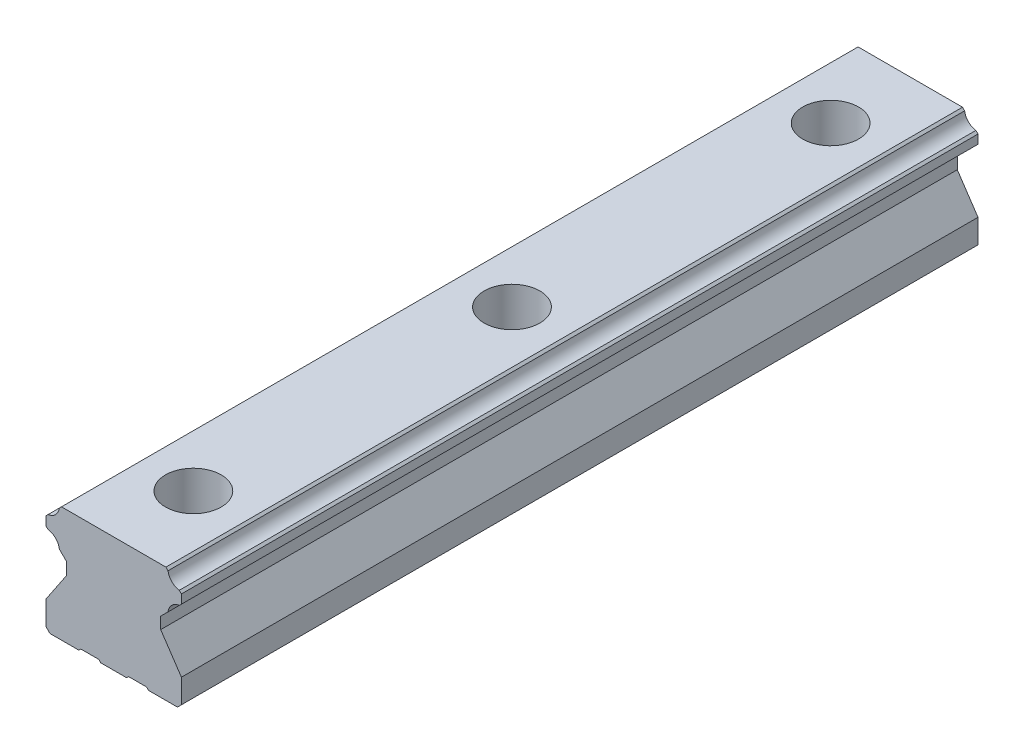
ISO-10303-21;
HEADER;
FILE_DESCRIPTION(('STEP AP214'),'2;1');
FILE_NAME('part.step','',(''),(''),'','','');
FILE_SCHEMA(('AUTOMOTIVE_DESIGN { 1 0 10303 214 1 1 1 1 }'));
ENDSEC;
DATA;
#1=APPLICATION_CONTEXT('core data for automotive mechanical design processes');
#2=APPLICATION_PROTOCOL_DEFINITION('international standard','automotive_design',2000,#1);
#3=PRODUCT_CONTEXT('',#1,'mechanical');
#4=PRODUCT('Part','Part','',(#3));
#5=PRODUCT_RELATED_PRODUCT_CATEGORY('part','',(#4));
#6=PRODUCT_DEFINITION_FORMATION('','',#4);
#7=PRODUCT_DEFINITION_CONTEXT('part definition',#1,'design');
#8=PRODUCT_DEFINITION('design','',#6,#7);
#9=PRODUCT_DEFINITION_SHAPE('','',#8);
#10=(LENGTH_UNIT() NAMED_UNIT(*) SI_UNIT(.MILLI.,.METRE.));
#11=(NAMED_UNIT(*) PLANE_ANGLE_UNIT() SI_UNIT($,.RADIAN.));
#12=(NAMED_UNIT(*) SI_UNIT($,.STERADIAN.) SOLID_ANGLE_UNIT());
#13=UNCERTAINTY_MEASURE_WITH_UNIT(LENGTH_MEASURE(1.E-05),#10,'distance_accuracy_value','');
#14=(GEOMETRIC_REPRESENTATION_CONTEXT(3) GLOBAL_UNCERTAINTY_ASSIGNED_CONTEXT((#13)) GLOBAL_UNIT_ASSIGNED_CONTEXT((#10,
#11,#12)) REPRESENTATION_CONTEXT('',''));
#15=CARTESIAN_POINT('',(0.,0.,0.));
#16=DIRECTION('',(0.,0.,1.));
#17=DIRECTION('',(1.,0.,0.));
#18=AXIS2_PLACEMENT_3D('',#15,#16,#17);
#19=CARTESIAN_POINT('',(3.75,0.5,-200.));
#20=DIRECTION('',(-0.707106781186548,0.707106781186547,0.));
#21=DIRECTION('',(-0.707106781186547,-0.707106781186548,0.));
#22=AXIS2_PLACEMENT_3D('',#19,#20,#21);
#23=PLANE('',#22);
#24=DIRECTION('',(0.,0.,1.));
#25=VECTOR('',#24,1.);
#26=CARTESIAN_POINT('',(3.75,0.5,-200.));
#27=LINE('',#26,#25);
#28=CARTESIAN_POINT('',(3.75,0.5,-200.));
#29=VERTEX_POINT('',#28);
#30=CARTESIAN_POINT('',(3.75,0.5,-182.487468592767));
#31=VERTEX_POINT('',#30);
#32=EDGE_CURVE('E337',#29,#31,#27,.T.);
#33=ORIENTED_EDGE('',*,*,#32,.T.);
#34=CARTESIAN_POINT('',(0.,-3.25,-180.));
#35=DIRECTION('',(-0.707106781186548,0.707106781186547,0.));
#36=DIRECTION('',(0.707106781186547,0.707106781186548,0.));
#37=AXIS2_PLACEMENT_3D('',#34,#35,#36);
#38=ELLIPSE('',#37,6.36396103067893,4.5);
#39=CARTESIAN_POINT('',(3.25,0.,-183.112474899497));
#40=VERTEX_POINT('',#39);
#41=EDGE_CURVE('E322',#31,#40,#38,.T.);
#42=ORIENTED_EDGE('',*,*,#41,.T.);
#43=DIRECTION('',(0.,0.,1.));
#44=VECTOR('',#43,1.);
#45=CARTESIAN_POINT('',(3.25,0.,-200.));
#46=LINE('',#45,#44);
#47=CARTESIAN_POINT('',(3.25,0.,-200.));
#48=VERTEX_POINT('',#47);
#49=EDGE_CURVE('E334',#48,#40,#46,.T.);
#50=ORIENTED_EDGE('',*,*,#49,.F.);
#51=DIRECTION('',(-0.707106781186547,-0.707106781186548,0.));
#52=VECTOR('',#51,1.);
#53=CARTESIAN_POINT('',(3.75,0.5,-200.));
#54=LINE('',#53,#52);
#55=EDGE_CURVE('E589',#29,#48,#54,.T.);
#56=ORIENTED_EDGE('',*,*,#55,.F.);
#57=EDGE_LOOP('',(#33,#42,#50,#56));
#58=FACE_BOUND('',#57,.T.);
#59=ADVANCED_FACE('F39',(#58),#23,.F.);
#60=CARTESIAN_POINT('',(-13.11,29.,-200.));
#61=DIRECTION('',(0.,-1.,0.));
#62=DIRECTION('',(0.,0.,-1.));
#63=AXIS2_PLACEMENT_3D('',#60,#61,#62);
#64=PLANE('',#63);
#65=CARTESIAN_POINT('',(0.,29.,-100.));
#66=DIRECTION('',(0.,1.,0.));
#67=DIRECTION('',(0.,0.,1.));
#68=AXIS2_PLACEMENT_3D('',#65,#66,#67);
#69=CIRCLE('',#68,7.);
#70=CARTESIAN_POINT('',(0.,29.,-93.));
#71=VERTEX_POINT('',#70);
#72=EDGE_CURVE('E339',#71,#71,#69,.T.);
#73=ORIENTED_EDGE('',*,*,#72,.F.);
#74=EDGE_LOOP('',(#73));
#75=FACE_BOUND('',#74,.T.);
#76=CARTESIAN_POINT('',(0.,29.,-20.));
#77=DIRECTION('',(0.,1.,0.));
#78=DIRECTION('',(0.,0.,1.));
#79=AXIS2_PLACEMENT_3D('',#76,#77,#78);
#80=CIRCLE('',#79,7.);
#81=CARTESIAN_POINT('',(0.,29.,-13.));
#82=VERTEX_POINT('',#81);
#83=EDGE_CURVE('E663',#82,#82,#80,.T.);
#84=ORIENTED_EDGE('',*,*,#83,.F.);
#85=EDGE_LOOP('',(#84));
#86=FACE_BOUND('',#85,.T.);
#87=DIRECTION('',(1.,0.,0.));
#88=VECTOR('',#87,1.);
#89=CARTESIAN_POINT('',(-13.11,29.,0.));
#90=LINE('',#89,#88);
#91=CARTESIAN_POINT('',(-13.11,29.,0.));
#92=VERTEX_POINT('',#91);
#93=CARTESIAN_POINT('',(13.11,29.,0.));
#94=VERTEX_POINT('',#93);
#95=EDGE_CURVE('E538',#92,#94,#90,.T.);
#96=ORIENTED_EDGE('',*,*,#95,.T.);
#97=DIRECTION('',(0.,0.,1.));
#98=VECTOR('',#97,1.);
#99=CARTESIAN_POINT('',(13.11,29.,-200.));
#100=LINE('',#99,#98);
#101=CARTESIAN_POINT('',(13.11,29.,-200.));
#102=VERTEX_POINT('',#101);
#103=EDGE_CURVE('E1252',#102,#94,#100,.T.);
#104=ORIENTED_EDGE('',*,*,#103,.F.);
#105=DIRECTION('',(1.,0.,0.));
#106=VECTOR('',#105,1.);
#107=CARTESIAN_POINT('',(-13.11,29.,-200.));
#108=LINE('',#107,#106);
#109=CARTESIAN_POINT('',(-13.11,29.,-200.));
#110=VERTEX_POINT('',#109);
#111=EDGE_CURVE('E634',#110,#102,#108,.T.);
#112=ORIENTED_EDGE('',*,*,#111,.F.);
#113=DIRECTION('',(0.,0.,1.));
#114=VECTOR('',#113,1.);
#115=CARTESIAN_POINT('',(-13.11,29.,-200.));
#116=LINE('',#115,#114);
#117=EDGE_CURVE('E1248',#110,#92,#116,.T.);
#118=ORIENTED_EDGE('',*,*,#117,.T.);
#119=EDGE_LOOP('',(#96,#104,#112,#118));
#120=FACE_BOUND('',#119,.T.);
#121=CARTESIAN_POINT('',(0.,29.,-180.));
#122=DIRECTION('',(0.,1.,0.));
#123=DIRECTION('',(0.,0.,1.));
#124=AXIS2_PLACEMENT_3D('',#121,#122,#123);
#125=CIRCLE('',#124,7.);
#126=CARTESIAN_POINT('',(0.,29.,-173.));
#127=VERTEX_POINT('',#126);
#128=EDGE_CURVE('E713',#127,#127,#125,.T.);
#129=ORIENTED_EDGE('',*,*,#128,.F.);
#130=EDGE_LOOP('',(#129));
#131=FACE_BOUND('',#130,.T.);
#132=ADVANCED_FACE('F720',(#75,#86,#120,#131),#64,.F.);
#133=CARTESIAN_POINT('',(-3.25,0.,-200.));
#134=DIRECTION('',(0.707106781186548,0.707106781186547,0.));
#135=DIRECTION('',(-0.707106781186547,0.707106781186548,0.));
#136=AXIS2_PLACEMENT_3D('',#133,#134,#135);
#137=PLANE('',#136);
#138=DIRECTION('',(0.,0.,1.));
#139=VECTOR('',#138,1.);
#140=CARTESIAN_POINT('',(-3.75,0.5,-200.));
#141=LINE('',#140,#139);
#142=CARTESIAN_POINT('',(-3.75,0.5,-177.512531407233));
#143=VERTEX_POINT('',#142);
#144=CARTESIAN_POINT('',(-3.75,0.5,-102.487468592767));
#145=VERTEX_POINT('',#144);
#146=EDGE_CURVE('E63',#143,#145,#141,.T.);
#147=ORIENTED_EDGE('',*,*,#146,.F.);
#148=CARTESIAN_POINT('',(0.,-3.25000000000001,-180.));
#149=DIRECTION('',(0.707106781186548,0.707106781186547,0.));
#150=DIRECTION('',(-0.707106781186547,0.707106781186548,0.));
#151=AXIS2_PLACEMENT_3D('',#148,#149,#150);
#152=ELLIPSE('',#151,6.36396103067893,4.5);
#153=CARTESIAN_POINT('',(-3.25,0.,-176.887525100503));
#154=VERTEX_POINT('',#153);
#155=EDGE_CURVE('E699',#143,#154,#152,.T.);
#156=ORIENTED_EDGE('',*,*,#155,.T.);
#157=DIRECTION('',(0.,0.,1.));
#158=VECTOR('',#157,1.);
#159=CARTESIAN_POINT('',(-3.25,0.,-200.));
#160=LINE('',#159,#158);
#161=CARTESIAN_POINT('',(-3.25,0.,-103.112474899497));
#162=VERTEX_POINT('',#161);
#163=EDGE_CURVE('E363',#154,#162,#160,.T.);
#164=ORIENTED_EDGE('',*,*,#163,.T.);
#165=CARTESIAN_POINT('',(0.,-3.25000000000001,-100.));
#166=DIRECTION('',(0.707106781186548,0.707106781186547,0.));
#167=DIRECTION('',(-0.707106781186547,0.707106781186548,0.));
#168=AXIS2_PLACEMENT_3D('',#165,#166,#167);
#169=ELLIPSE('',#168,6.36396103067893,4.5);
#170=EDGE_CURVE('E1231',#162,#145,#169,.T.);
#171=ORIENTED_EDGE('',*,*,#170,.T.);
#172=EDGE_LOOP('',(#147,#156,#164,#171));
#173=FACE_BOUND('',#172,.T.);
#174=ADVANCED_FACE('F722',(#173),#137,.F.);
#175=CARTESIAN_POINT('',(3.25,0.,-200.));
#176=DIRECTION('',(0.,1.,0.));
#177=DIRECTION('',(0.,0.,1.));
#178=AXIS2_PLACEMENT_3D('',#175,#176,#177);
#179=PLANE('',#178);
#180=ORIENTED_EDGE('',*,*,#49,.T.);
#181=CARTESIAN_POINT('',(0.,0.,-180.));
#182=DIRECTION('',(0.,1.,0.));
#183=DIRECTION('',(0.,0.,1.));
#184=AXIS2_PLACEMENT_3D('',#181,#182,#183);
#185=CIRCLE('',#184,4.5);
#186=CARTESIAN_POINT('',(-3.25,0.,-183.112474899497));
#187=VERTEX_POINT('',#186);
#188=EDGE_CURVE('E11',#40,#187,#185,.T.);
#189=ORIENTED_EDGE('',*,*,#188,.T.);
#190=CARTESIAN_POINT('',(-3.25,0.,-200.));
#191=VERTEX_POINT('',#190);
#192=EDGE_CURVE('E355',#191,#187,#160,.T.);
#193=ORIENTED_EDGE('',*,*,#192,.F.);
#194=DIRECTION('',(-1.,0.,0.));
#195=VECTOR('',#194,1.);
#196=CARTESIAN_POINT('',(3.25,0.,-200.));
#197=LINE('',#196,#195);
#198=EDGE_CURVE('E342',#48,#191,#197,.T.);
#199=ORIENTED_EDGE('',*,*,#198,.F.);
#200=EDGE_LOOP('',(#180,#189,#193,#199));
#201=FACE_BOUND('',#200,.T.);
#202=ADVANCED_FACE('F341',(#201),#179,.F.);
#203=CARTESIAN_POINT('',(3.25,0.,-176.887525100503));
#204=VERTEX_POINT('',#203);
#205=CARTESIAN_POINT('',(3.25,0.,-103.112474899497));
#206=VERTEX_POINT('',#205);
#207=EDGE_CURVE('E345',#204,#206,#46,.T.);
#208=ORIENTED_EDGE('',*,*,#207,.F.);
#209=CARTESIAN_POINT('',(3.75,0.5,-177.512531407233));
#210=VERTEX_POINT('',#209);
#211=EDGE_CURVE('E55',#204,#210,#38,.T.);
#212=ORIENTED_EDGE('',*,*,#211,.T.);
#213=CARTESIAN_POINT('',(3.75,0.5,-102.487468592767));
#214=VERTEX_POINT('',#213);
#215=EDGE_CURVE('E1308',#210,#214,#27,.T.);
#216=ORIENTED_EDGE('',*,*,#215,.T.);
#217=CARTESIAN_POINT('',(0.,-3.25,-100.));
#218=DIRECTION('',(-0.707106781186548,0.707106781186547,0.));
#219=DIRECTION('',(0.707106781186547,0.707106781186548,0.));
#220=AXIS2_PLACEMENT_3D('',#217,#218,#219);
#221=ELLIPSE('',#220,6.36396103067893,4.5);
#222=EDGE_CURVE('E667',#214,#206,#221,.T.);
#223=ORIENTED_EDGE('',*,*,#222,.T.);
#224=EDGE_LOOP('',(#208,#212,#216,#223));
#225=FACE_BOUND('',#224,.T.);
#226=ADVANCED_FACE('F733',(#225),#23,.F.);
#227=ORIENTED_EDGE('',*,*,#163,.F.);
#228=EDGE_CURVE('E43',#154,#204,#185,.T.);
#229=ORIENTED_EDGE('',*,*,#228,.T.);
#230=ORIENTED_EDGE('',*,*,#207,.T.);
#231=CARTESIAN_POINT('',(0.,0.,-100.));
#232=DIRECTION('',(0.,1.,0.));
#233=DIRECTION('',(0.,0.,1.));
#234=AXIS2_PLACEMENT_3D('',#231,#232,#233);
#235=CIRCLE('',#234,4.49999999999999);
#236=EDGE_CURVE('E679',#206,#162,#235,.T.);
#237=ORIENTED_EDGE('',*,*,#236,.T.);
#238=EDGE_LOOP('',(#227,#229,#230,#237));
#239=FACE_BOUND('',#238,.T.);
#240=ADVANCED_FACE('F1077',(#239),#179,.F.);
#241=CARTESIAN_POINT('',(-3.75,0.5,-97.5125314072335));
#242=VERTEX_POINT('',#241);
#243=CARTESIAN_POINT('',(-3.75,0.5,-22.4874685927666));
#244=VERTEX_POINT('',#243);
#245=EDGE_CURVE('E383',#242,#244,#141,.T.);
#246=ORIENTED_EDGE('',*,*,#245,.F.);
#247=CARTESIAN_POINT('',(-3.25,0.,-96.8875251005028));
#248=VERTEX_POINT('',#247);
#249=EDGE_CURVE('E1236',#242,#248,#169,.T.);
#250=ORIENTED_EDGE('',*,*,#249,.T.);
#251=CARTESIAN_POINT('',(-3.25,0.,-23.1124748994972));
#252=VERTEX_POINT('',#251);
#253=EDGE_CURVE('E368',#248,#252,#160,.T.);
#254=ORIENTED_EDGE('',*,*,#253,.T.);
#255=CARTESIAN_POINT('',(0.,-3.25000000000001,-20.));
#256=DIRECTION('',(0.707106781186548,0.707106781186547,0.));
#257=DIRECTION('',(-0.707106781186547,0.707106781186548,0.));
#258=AXIS2_PLACEMENT_3D('',#255,#256,#257);
#259=ELLIPSE('',#258,6.36396103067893,4.5);
#260=EDGE_CURVE('E1244',#252,#244,#259,.T.);
#261=ORIENTED_EDGE('',*,*,#260,.T.);
#262=EDGE_LOOP('',(#246,#250,#254,#261));
#263=FACE_BOUND('',#262,.T.);
#264=ADVANCED_FACE('F730',(#263),#137,.F.);
#265=CARTESIAN_POINT('',(3.25,0.,-96.8875251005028));
#266=VERTEX_POINT('',#265);
#267=CARTESIAN_POINT('',(3.25,0.,-23.1124748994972));
#268=VERTEX_POINT('',#267);
#269=EDGE_CURVE('E352',#266,#268,#46,.T.);
#270=ORIENTED_EDGE('',*,*,#269,.F.);
#271=CARTESIAN_POINT('',(3.75,0.5,-97.5125314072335));
#272=VERTEX_POINT('',#271);
#273=EDGE_CURVE('E668',#266,#272,#221,.T.);
#274=ORIENTED_EDGE('',*,*,#273,.T.);
#275=CARTESIAN_POINT('',(3.75,0.5,-22.4874685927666));
#276=VERTEX_POINT('',#275);
#277=EDGE_CURVE('E350',#272,#276,#27,.T.);
#278=ORIENTED_EDGE('',*,*,#277,.T.);
#279=CARTESIAN_POINT('',(0.,-3.25,-20.));
#280=DIRECTION('',(-0.707106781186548,0.707106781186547,0.));
#281=DIRECTION('',(0.707106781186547,0.707106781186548,0.));
#282=AXIS2_PLACEMENT_3D('',#279,#280,#281);
#283=ELLIPSE('',#282,6.36396103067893,4.5);
#284=EDGE_CURVE('E545',#276,#268,#283,.T.);
#285=ORIENTED_EDGE('',*,*,#284,.T.);
#286=EDGE_LOOP('',(#270,#274,#278,#285));
#287=FACE_BOUND('',#286,.T.);
#288=ADVANCED_FACE('F797',(#287),#23,.F.);
#289=ORIENTED_EDGE('',*,*,#253,.F.);
#290=EDGE_CURVE('E680',#248,#266,#235,.T.);
#291=ORIENTED_EDGE('',*,*,#290,.T.);
#292=ORIENTED_EDGE('',*,*,#269,.T.);
#293=CARTESIAN_POINT('',(0.,0.,-20.));
#294=DIRECTION('',(0.,1.,0.));
#295=DIRECTION('',(0.,0.,1.));
#296=AXIS2_PLACEMENT_3D('',#293,#294,#295);
#297=CIRCLE('',#296,4.49999999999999);
#298=EDGE_CURVE('E651',#268,#252,#297,.T.);
#299=ORIENTED_EDGE('',*,*,#298,.T.);
#300=EDGE_LOOP('',(#289,#291,#292,#299));
#301=FACE_BOUND('',#300,.T.);
#302=ADVANCED_FACE('F799',(#301),#179,.F.);
#303=CARTESIAN_POINT('',(-3.75,0.5,-17.5125314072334));
#304=VERTEX_POINT('',#303);
#305=CARTESIAN_POINT('',(-3.75,0.5,0.));
#306=VERTEX_POINT('',#305);
#307=EDGE_CURVE('E379',#304,#306,#141,.T.);
#308=ORIENTED_EDGE('',*,*,#307,.F.);
#309=CARTESIAN_POINT('',(-3.25,0.,-16.8875251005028));
#310=VERTEX_POINT('',#309);
#311=EDGE_CURVE('E1242',#304,#310,#259,.T.);
#312=ORIENTED_EDGE('',*,*,#311,.T.);
#313=CARTESIAN_POINT('',(-3.25,0.,0.));
#314=VERTEX_POINT('',#313);
#315=EDGE_CURVE('E364',#310,#314,#160,.T.);
#316=ORIENTED_EDGE('',*,*,#315,.T.);
#317=DIRECTION('',(-0.707106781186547,0.707106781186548,0.));
#318=VECTOR('',#317,1.);
#319=CARTESIAN_POINT('',(-3.25,0.,0.));
#320=LINE('',#319,#318);
#321=EDGE_CURVE('E486',#314,#306,#320,.T.);
#322=ORIENTED_EDGE('',*,*,#321,.T.);
#323=EDGE_LOOP('',(#308,#312,#316,#322));
#324=FACE_BOUND('',#323,.T.);
#325=ADVANCED_FACE('F803',(#324),#137,.F.);
#326=CARTESIAN_POINT('',(-13.639381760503,28.470618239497,-200.));
#327=DIRECTION('',(0.707106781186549,-0.707106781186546,0.));
#328=DIRECTION('',(0.707106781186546,0.707106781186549,0.));
#329=AXIS2_PLACEMENT_3D('',#326,#327,#328);
#330=PLANE('',#329);
#331=DIRECTION('',(0.707106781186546,0.707106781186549,0.));
#332=VECTOR('',#331,1.);
#333=CARTESIAN_POINT('',(-13.639381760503,28.470618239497,0.));
#334=LINE('',#333,#332);
#335=CARTESIAN_POINT('',(-13.639381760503,28.470618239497,0.));
#336=VERTEX_POINT('',#335);
#337=EDGE_CURVE('E541',#336,#92,#334,.T.);
#338=ORIENTED_EDGE('',*,*,#337,.T.);
#339=ORIENTED_EDGE('',*,*,#117,.F.);
#340=DIRECTION('',(0.707106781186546,0.707106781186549,0.));
#341=VECTOR('',#340,1.);
#342=CARTESIAN_POINT('',(-13.639381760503,28.470618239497,-200.));
#343=LINE('',#342,#341);
#344=CARTESIAN_POINT('',(-13.639381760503,28.470618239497,-200.));
#345=VERTEX_POINT('',#344);
#346=EDGE_CURVE('E449',#345,#110,#343,.T.);
#347=ORIENTED_EDGE('',*,*,#346,.F.);
#348=DIRECTION('',(0.,0.,1.));
#349=VECTOR('',#348,1.);
#350=CARTESIAN_POINT('',(-13.639381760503,28.470618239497,-200.));
#351=LINE('',#350,#349);
#352=EDGE_CURVE('E441',#345,#336,#351,.T.);
#353=ORIENTED_EDGE('',*,*,#352,.T.);
#354=EDGE_LOOP('',(#338,#339,#347,#353));
#355=FACE_BOUND('',#354,.T.);
#356=ADVANCED_FACE('F41',(#355),#330,.F.);
#357=CARTESIAN_POINT('',(13.11,29.,-200.));
#358=DIRECTION('',(-0.707106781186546,-0.707106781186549,0.));
#359=DIRECTION('',(0.707106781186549,-0.707106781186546,0.));
#360=AXIS2_PLACEMENT_3D('',#357,#358,#359);
#361=PLANE('',#360);
#362=DIRECTION('',(0.707106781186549,-0.707106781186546,0.));
#363=VECTOR('',#362,1.);
#364=CARTESIAN_POINT('',(13.11,29.,0.));
#365=LINE('',#364,#363);
#366=CARTESIAN_POINT('',(13.639381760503,28.470618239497,0.));
#367=VERTEX_POINT('',#366);
#368=EDGE_CURVE('E535',#94,#367,#365,.T.);
#369=ORIENTED_EDGE('',*,*,#368,.T.);
#370=DIRECTION('',(0.,0.,1.));
#371=VECTOR('',#370,1.);
#372=CARTESIAN_POINT('',(13.639381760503,28.470618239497,-200.));
#373=LINE('',#372,#371);
#374=CARTESIAN_POINT('',(13.639381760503,28.470618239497,-200.));
#375=VERTEX_POINT('',#374);
#376=EDGE_CURVE('E1256',#375,#367,#373,.T.);
#377=ORIENTED_EDGE('',*,*,#376,.F.);
#378=DIRECTION('',(0.707106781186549,-0.707106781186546,0.));
#379=VECTOR('',#378,1.);
#380=CARTESIAN_POINT('',(13.11,29.,-200.));
#381=LINE('',#380,#379);
#382=EDGE_CURVE('E631',#102,#375,#381,.T.);
#383=ORIENTED_EDGE('',*,*,#382,.F.);
#384=ORIENTED_EDGE('',*,*,#103,.T.);
#385=EDGE_LOOP('',(#369,#377,#383,#384));
#386=FACE_BOUND('',#385,.T.);
#387=ADVANCED_FACE('F738',(#386),#361,.F.);
#388=CARTESIAN_POINT('',(16.9100000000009,28.9100000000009,-200.));
#389=DIRECTION('',(0.,0.,1.));
#390=DIRECTION('',(1.,0.,0.));
#391=AXIS2_PLACEMENT_3D('',#388,#389,#390);
#392=CYLINDRICAL_SURFACE('',#391,3.3);
#393=CARTESIAN_POINT('',(16.9100000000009,28.9100000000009,0.));
#394=DIRECTION('',(0.,0.,1.));
#395=DIRECTION('',(1.,0.,0.));
#396=AXIS2_PLACEMENT_3D('',#393,#394,#395);
#397=CIRCLE('',#396,3.3);
#398=CARTESIAN_POINT('',(16.470618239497,25.639381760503,0.));
#399=VERTEX_POINT('',#398);
#400=EDGE_CURVE('E532',#367,#399,#397,.T.);
#401=ORIENTED_EDGE('',*,*,#400,.T.);
#402=DIRECTION('',(0.,0.,1.));
#403=VECTOR('',#402,1.);
#404=CARTESIAN_POINT('',(16.470618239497,25.639381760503,-200.));
#405=LINE('',#404,#403);
#406=CARTESIAN_POINT('',(16.470618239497,25.639381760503,-200.));
#407=VERTEX_POINT('',#406);
#408=EDGE_CURVE('E1260',#407,#399,#405,.T.);
#409=ORIENTED_EDGE('',*,*,#408,.F.);
#410=CARTESIAN_POINT('',(16.9100000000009,28.9100000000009,-200.));
#411=DIRECTION('',(0.,0.,1.));
#412=DIRECTION('',(1.,0.,0.));
#413=AXIS2_PLACEMENT_3D('',#410,#411,#412);
#414=CIRCLE('',#413,3.3);
#415=EDGE_CURVE('E628',#375,#407,#414,.T.);
#416=ORIENTED_EDGE('',*,*,#415,.F.);
#417=ORIENTED_EDGE('',*,*,#376,.T.);
#418=EDGE_LOOP('',(#401,#409,#416,#417));
#419=FACE_BOUND('',#418,.T.);
#420=ADVANCED_FACE('F741',(#419),#392,.F.);
#421=CARTESIAN_POINT('',(16.470618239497,25.639381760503,-200.));
#422=DIRECTION('',(-0.707106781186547,-0.707106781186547,0.));
#423=DIRECTION('',(0.707106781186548,-0.707106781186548,0.));
#424=AXIS2_PLACEMENT_3D('',#421,#422,#423);
#425=PLANE('',#424);
#426=DIRECTION('',(0.707106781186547,-0.707106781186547,0.));
#427=VECTOR('',#426,1.);
#428=CARTESIAN_POINT('',(16.470618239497,25.639381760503,0.));
#429=LINE('',#428,#427);
#430=CARTESIAN_POINT('',(17.,25.11,0.));
#431=VERTEX_POINT('',#430);
#432=EDGE_CURVE('E529',#399,#431,#429,.T.);
#433=ORIENTED_EDGE('',*,*,#432,.T.);
#434=DIRECTION('',(0.,0.,1.));
#435=VECTOR('',#434,1.);
#436=CARTESIAN_POINT('',(17.,25.11,-200.));
#437=LINE('',#436,#435);
#438=CARTESIAN_POINT('',(17.,25.11,-200.));
#439=VERTEX_POINT('',#438);
#440=EDGE_CURVE('E1264',#439,#431,#437,.T.);
#441=ORIENTED_EDGE('',*,*,#440,.F.);
#442=DIRECTION('',(0.707106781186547,-0.707106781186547,0.));
#443=VECTOR('',#442,1.);
#444=CARTESIAN_POINT('',(16.470618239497,25.639381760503,-200.));
#445=LINE('',#444,#443);
#446=EDGE_CURVE('E625',#407,#439,#445,.T.);
#447=ORIENTED_EDGE('',*,*,#446,.F.);
#448=ORIENTED_EDGE('',*,*,#408,.T.);
#449=EDGE_LOOP('',(#433,#441,#447,#448));
#450=FACE_BOUND('',#449,.T.);
#451=ADVANCED_FACE('F745',(#450),#425,.F.);
#452=CARTESIAN_POINT('',(17.,25.11,-200.));
#453=DIRECTION('',(-1.,0.,0.));
#454=DIRECTION('',(0.,0.,1.));
#455=AXIS2_PLACEMENT_3D('',#452,#453,#454);
#456=PLANE('',#455);
#457=DIRECTION('',(0.,-1.,0.));
#458=VECTOR('',#457,1.);
#459=CARTESIAN_POINT('',(17.,25.11,0.));
#460=LINE('',#459,#458);
#461=CARTESIAN_POINT('',(17.,22.88,0.));
#462=VERTEX_POINT('',#461);
#463=EDGE_CURVE('E526',#431,#462,#460,.T.);
#464=ORIENTED_EDGE('',*,*,#463,.T.);
#465=DIRECTION('',(0.,0.,1.));
#466=VECTOR('',#465,1.);
#467=CARTESIAN_POINT('',(17.,22.88,-200.));
#468=LINE('',#467,#466);
#469=CARTESIAN_POINT('',(17.,22.88,-200.));
#470=VERTEX_POINT('',#469);
#471=EDGE_CURVE('E1268',#470,#462,#468,.T.);
#472=ORIENTED_EDGE('',*,*,#471,.F.);
#473=DIRECTION('',(0.,-1.,0.));
#474=VECTOR('',#473,1.);
#475=CARTESIAN_POINT('',(17.,25.11,-200.));
#476=LINE('',#475,#474);
#477=EDGE_CURVE('E622',#439,#470,#476,.T.);
#478=ORIENTED_EDGE('',*,*,#477,.F.);
#479=ORIENTED_EDGE('',*,*,#440,.T.);
#480=EDGE_LOOP('',(#464,#472,#478,#479));
#481=FACE_BOUND('',#480,.T.);
#482=ADVANCED_FACE('F749',(#481),#456,.F.);
#483=CARTESIAN_POINT('',(17.,22.88,-200.));
#484=DIRECTION('',(-0.707106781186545,0.70710678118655,0.));
#485=DIRECTION('',(-0.70710678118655,-0.707106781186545,0.));
#486=AXIS2_PLACEMENT_3D('',#483,#484,#485);
#487=PLANE('',#486);
#488=DIRECTION('',(-0.70710678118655,-0.707106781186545,0.));
#489=VECTOR('',#488,1.);
#490=CARTESIAN_POINT('',(17.,22.88,0.));
#491=LINE('',#490,#489);
#492=CARTESIAN_POINT('',(16.4821462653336,22.3621462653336,0.));
#493=VERTEX_POINT('',#492);
#494=EDGE_CURVE('E523',#462,#493,#491,.T.);
#495=ORIENTED_EDGE('',*,*,#494,.T.);
#496=DIRECTION('',(0.,0.,1.));
#497=VECTOR('',#496,1.);
#498=CARTESIAN_POINT('',(16.4821462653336,22.3621462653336,-200.));
#499=LINE('',#498,#497);
#500=CARTESIAN_POINT('',(16.4821462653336,22.3621462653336,-200.));
#501=VERTEX_POINT('',#500);
#502=EDGE_CURVE('E1272',#501,#493,#499,.T.);
#503=ORIENTED_EDGE('',*,*,#502,.F.);
#504=DIRECTION('',(-0.70710678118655,-0.707106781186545,0.));
#505=VECTOR('',#504,1.);
#506=CARTESIAN_POINT('',(17.,22.88,-200.));
#507=LINE('',#506,#505);
#508=EDGE_CURVE('E619',#470,#501,#507,.T.);
#509=ORIENTED_EDGE('',*,*,#508,.F.);
#510=ORIENTED_EDGE('',*,*,#471,.T.);
#511=EDGE_LOOP('',(#495,#503,#509,#510));
#512=FACE_BOUND('',#511,.T.);
#513=ADVANCED_FACE('F753',(#512),#487,.F.);
#514=CARTESIAN_POINT('',(16.9099999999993,19.0900000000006,-200.));
#515=DIRECTION('',(0.,0.,1.));
#516=DIRECTION('',(1.,0.,0.));
#517=AXIS2_PLACEMENT_3D('',#514,#515,#516);
#518=CYLINDRICAL_SURFACE('',#517,3.30000000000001);
#519=CARTESIAN_POINT('',(16.9099999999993,19.0900000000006,0.));
#520=DIRECTION('',(0.,0.,1.));
#521=DIRECTION('',(1.,0.,0.));
#522=AXIS2_PLACEMENT_3D('',#519,#520,#521);
#523=CIRCLE('',#522,3.30000000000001);
#524=CARTESIAN_POINT('',(13.6378537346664,19.5178537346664,0.));
#525=VERTEX_POINT('',#524);
#526=EDGE_CURVE('E520',#493,#525,#523,.T.);
#527=ORIENTED_EDGE('',*,*,#526,.T.);
#528=DIRECTION('',(0.,0.,1.));
#529=VECTOR('',#528,1.);
#530=CARTESIAN_POINT('',(13.6378537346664,19.5178537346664,-200.));
#531=LINE('',#530,#529);
#532=CARTESIAN_POINT('',(13.6378537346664,19.5178537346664,-200.));
#533=VERTEX_POINT('',#532);
#534=EDGE_CURVE('E1276',#533,#525,#531,.T.);
#535=ORIENTED_EDGE('',*,*,#534,.F.);
#536=CARTESIAN_POINT('',(16.9099999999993,19.0900000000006,-200.));
#537=DIRECTION('',(0.,0.,1.));
#538=DIRECTION('',(1.,0.,0.));
#539=AXIS2_PLACEMENT_3D('',#536,#537,#538);
#540=CIRCLE('',#539,3.30000000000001);
#541=EDGE_CURVE('E616',#501,#533,#540,.T.);
#542=ORIENTED_EDGE('',*,*,#541,.F.);
#543=ORIENTED_EDGE('',*,*,#502,.T.);
#544=EDGE_LOOP('',(#527,#535,#542,#543));
#545=FACE_BOUND('',#544,.T.);
#546=ADVANCED_FACE('F757',(#545),#518,.F.);
#547=CARTESIAN_POINT('',(13.6378537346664,19.5178537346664,-200.));
#548=DIRECTION('',(-0.707106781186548,0.707106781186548,0.));
#549=DIRECTION('',(-0.707106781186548,-0.707106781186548,0.));
#550=AXIS2_PLACEMENT_3D('',#547,#548,#549);
#551=PLANE('',#550);
#552=DIRECTION('',(-0.707106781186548,-0.707106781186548,0.));
#553=VECTOR('',#552,1.);
#554=CARTESIAN_POINT('',(13.6378537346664,19.5178537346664,0.));
#555=LINE('',#554,#553);
#556=CARTESIAN_POINT('',(11.8,17.68,0.));
#557=VERTEX_POINT('',#556);
#558=EDGE_CURVE('E517',#525,#557,#555,.T.);
#559=ORIENTED_EDGE('',*,*,#558,.T.);
#560=DIRECTION('',(0.,0.,1.));
#561=VECTOR('',#560,1.);
#562=CARTESIAN_POINT('',(11.8,17.68,-200.));
#563=LINE('',#562,#561);
#564=CARTESIAN_POINT('',(11.8,17.68,-200.));
#565=VERTEX_POINT('',#564);
#566=EDGE_CURVE('E1280',#565,#557,#563,.T.);
#567=ORIENTED_EDGE('',*,*,#566,.F.);
#568=DIRECTION('',(-0.707106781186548,-0.707106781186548,0.));
#569=VECTOR('',#568,1.);
#570=CARTESIAN_POINT('',(13.6378537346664,19.5178537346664,-200.));
#571=LINE('',#570,#569);
#572=EDGE_CURVE('E613',#533,#565,#571,.T.);
#573=ORIENTED_EDGE('',*,*,#572,.F.);
#574=ORIENTED_EDGE('',*,*,#534,.T.);
#575=EDGE_LOOP('',(#559,#567,#573,#574));
#576=FACE_BOUND('',#575,.T.);
#577=ADVANCED_FACE('F761',(#576),#551,.F.);
#578=CARTESIAN_POINT('',(11.8,17.68,-200.));
#579=DIRECTION('',(-1.,0.,0.));
#580=DIRECTION('',(0.,0.,1.));
#581=AXIS2_PLACEMENT_3D('',#578,#579,#580);
#582=PLANE('',#581);
#583=DIRECTION('',(0.,-1.,0.));
#584=VECTOR('',#583,1.);
#585=CARTESIAN_POINT('',(11.8,17.68,0.));
#586=LINE('',#585,#584);
#587=CARTESIAN_POINT('',(11.8,14.75,0.));
#588=VERTEX_POINT('',#587);
#589=EDGE_CURVE('E514',#557,#588,#586,.T.);
#590=ORIENTED_EDGE('',*,*,#589,.T.);
#591=DIRECTION('',(0.,0.,1.));
#592=VECTOR('',#591,1.);
#593=CARTESIAN_POINT('',(11.8,14.75,-200.));
#594=LINE('',#593,#592);
#595=CARTESIAN_POINT('',(11.8,14.75,-200.));
#596=VERTEX_POINT('',#595);
#597=EDGE_CURVE('E1284',#596,#588,#594,.T.);
#598=ORIENTED_EDGE('',*,*,#597,.F.);
#599=DIRECTION('',(0.,-1.,0.));
#600=VECTOR('',#599,1.);
#601=CARTESIAN_POINT('',(11.8,17.68,-200.));
#602=LINE('',#601,#600);
#603=EDGE_CURVE('E610',#565,#596,#602,.T.);
#604=ORIENTED_EDGE('',*,*,#603,.F.);
#605=ORIENTED_EDGE('',*,*,#566,.T.);
#606=EDGE_LOOP('',(#590,#598,#604,#605));
#607=FACE_BOUND('',#606,.T.);
#608=ADVANCED_FACE('F765',(#607),#582,.F.);
#609=CARTESIAN_POINT('',(11.8,14.75,-200.));
#610=DIRECTION('',(-0.830398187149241,-0.557170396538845,0.));
#611=DIRECTION('',(0.557170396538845,-0.830398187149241,0.));
#612=AXIS2_PLACEMENT_3D('',#609,#610,#611);
#613=PLANE('',#612);
#614=DIRECTION('',(0.557170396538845,-0.830398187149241,0.));
#615=VECTOR('',#614,1.);
#616=CARTESIAN_POINT('',(11.8,14.75,0.));
#617=LINE('',#616,#615);
#618=CARTESIAN_POINT('',(17.,7.,0.));
#619=VERTEX_POINT('',#618);
#620=EDGE_CURVE('E511',#588,#619,#617,.T.);
#621=ORIENTED_EDGE('',*,*,#620,.T.);
#622=DIRECTION('',(0.,0.,1.));
#623=VECTOR('',#622,1.);
#624=CARTESIAN_POINT('',(17.,7.,-200.));
#625=LINE('',#624,#623);
#626=CARTESIAN_POINT('',(17.,7.,-200.));
#627=VERTEX_POINT('',#626);
#628=EDGE_CURVE('E1288',#627,#619,#625,.T.);
#629=ORIENTED_EDGE('',*,*,#628,.F.);
#630=DIRECTION('',(0.557170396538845,-0.830398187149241,0.));
#631=VECTOR('',#630,1.);
#632=CARTESIAN_POINT('',(11.8,14.75,-200.));
#633=LINE('',#632,#631);
#634=EDGE_CURVE('E607',#596,#627,#633,.T.);
#635=ORIENTED_EDGE('',*,*,#634,.F.);
#636=ORIENTED_EDGE('',*,*,#597,.T.);
#637=EDGE_LOOP('',(#621,#629,#635,#636));
#638=FACE_BOUND('',#637,.T.);
#639=ADVANCED_FACE('F769',(#638),#613,.F.);
#640=CARTESIAN_POINT('',(17.,7.,-200.));
#641=DIRECTION('',(-1.,0.,0.));
#642=DIRECTION('',(0.,0.,1.));
#643=AXIS2_PLACEMENT_3D('',#640,#641,#642);
#644=PLANE('',#643);
#645=DIRECTION('',(0.,-1.,0.));
#646=VECTOR('',#645,1.);
#647=CARTESIAN_POINT('',(17.,7.,0.));
#648=LINE('',#647,#646);
#649=CARTESIAN_POINT('',(17.,1.,0.));
#650=VERTEX_POINT('',#649);
#651=EDGE_CURVE('E508',#619,#650,#648,.T.);
#652=ORIENTED_EDGE('',*,*,#651,.T.);
#653=DIRECTION('',(0.,0.,1.));
#654=VECTOR('',#653,1.);
#655=CARTESIAN_POINT('',(17.,1.,-200.));
#656=LINE('',#655,#654);
#657=CARTESIAN_POINT('',(17.,1.,-200.));
#658=VERTEX_POINT('',#657);
#659=EDGE_CURVE('E1292',#658,#650,#656,.T.);
#660=ORIENTED_EDGE('',*,*,#659,.F.);
#661=DIRECTION('',(0.,-1.,0.));
#662=VECTOR('',#661,1.);
#663=CARTESIAN_POINT('',(17.,7.,-200.));
#664=LINE('',#663,#662);
#665=EDGE_CURVE('E604',#627,#658,#664,.T.);
#666=ORIENTED_EDGE('',*,*,#665,.F.);
#667=ORIENTED_EDGE('',*,*,#628,.T.);
#668=EDGE_LOOP('',(#652,#660,#666,#667));
#669=FACE_BOUND('',#668,.T.);
#670=ADVANCED_FACE('F773',(#669),#644,.F.);
#671=CARTESIAN_POINT('',(17.,1.,-200.));
#672=DIRECTION('',(-0.707106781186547,0.707106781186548,0.));
#673=DIRECTION('',(-0.707106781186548,-0.707106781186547,0.));
#674=AXIS2_PLACEMENT_3D('',#671,#672,#673);
#675=PLANE('',#674);
#676=DIRECTION('',(-0.707106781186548,-0.707106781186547,0.));
#677=VECTOR('',#676,1.);
#678=CARTESIAN_POINT('',(17.,1.,0.));
#679=LINE('',#678,#677);
#680=CARTESIAN_POINT('',(16.,0.,0.));
#681=VERTEX_POINT('',#680);
#682=EDGE_CURVE('E505',#650,#681,#679,.T.);
#683=ORIENTED_EDGE('',*,*,#682,.T.);
#684=DIRECTION('',(0.,0.,1.));
#685=VECTOR('',#684,1.);
#686=CARTESIAN_POINT('',(16.,0.,-200.));
#687=LINE('',#686,#685);
#688=CARTESIAN_POINT('',(16.,0.,-200.));
#689=VERTEX_POINT('',#688);
#690=EDGE_CURVE('E1296',#689,#681,#687,.T.);
#691=ORIENTED_EDGE('',*,*,#690,.F.);
#692=DIRECTION('',(-0.707106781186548,-0.707106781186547,0.));
#693=VECTOR('',#692,1.);
#694=CARTESIAN_POINT('',(17.,1.,-200.));
#695=LINE('',#694,#693);
#696=EDGE_CURVE('E601',#658,#689,#695,.T.);
#697=ORIENTED_EDGE('',*,*,#696,.F.);
#698=ORIENTED_EDGE('',*,*,#659,.T.);
#699=EDGE_LOOP('',(#683,#691,#697,#698));
#700=FACE_BOUND('',#699,.T.);
#701=ADVANCED_FACE('F777',(#700),#675,.F.);
#702=CARTESIAN_POINT('',(16.,0.,-200.));
#703=DIRECTION('',(0.,1.,0.));
#704=DIRECTION('',(0.,0.,1.));
#705=AXIS2_PLACEMENT_3D('',#702,#703,#704);
#706=PLANE('',#705);
#707=DIRECTION('',(-1.,0.,0.));
#708=VECTOR('',#707,1.);
#709=CARTESIAN_POINT('',(16.,0.,0.));
#710=LINE('',#709,#708);
#711=CARTESIAN_POINT('',(8.75,0.,0.));
#712=VERTEX_POINT('',#711);
#713=EDGE_CURVE('E502',#681,#712,#710,.T.);
#714=ORIENTED_EDGE('',*,*,#713,.T.);
#715=DIRECTION('',(0.,0.,1.));
#716=VECTOR('',#715,1.);
#717=CARTESIAN_POINT('',(8.75,0.,-200.));
#718=LINE('',#717,#716);
#719=CARTESIAN_POINT('',(8.75,0.,-200.));
#720=VERTEX_POINT('',#719);
#721=EDGE_CURVE('E1300',#720,#712,#718,.T.);
#722=ORIENTED_EDGE('',*,*,#721,.F.);
#723=DIRECTION('',(-1.,0.,0.));
#724=VECTOR('',#723,1.);
#725=CARTESIAN_POINT('',(16.,0.,-200.));
#726=LINE('',#725,#724);
#727=EDGE_CURVE('E598',#689,#720,#726,.T.);
#728=ORIENTED_EDGE('',*,*,#727,.F.);
#729=ORIENTED_EDGE('',*,*,#690,.T.);
#730=EDGE_LOOP('',(#714,#722,#728,#729));
#731=FACE_BOUND('',#730,.T.);
#732=ADVANCED_FACE('F781',(#731),#706,.F.);
#733=CARTESIAN_POINT('',(8.75,0.,-200.));
#734=DIRECTION('',(0.707106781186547,0.707106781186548,0.));
#735=DIRECTION('',(-0.707106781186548,0.707106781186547,0.));
#736=AXIS2_PLACEMENT_3D('',#733,#734,#735);
#737=PLANE('',#736);
#738=DIRECTION('',(-0.707106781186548,0.707106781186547,0.));
#739=VECTOR('',#738,1.);
#740=CARTESIAN_POINT('',(8.75,0.,0.));
#741=LINE('',#740,#739);
#742=CARTESIAN_POINT('',(8.25,0.5,0.));
#743=VERTEX_POINT('',#742);
#744=EDGE_CURVE('E499',#712,#743,#741,.T.);
#745=ORIENTED_EDGE('',*,*,#744,.T.);
#746=DIRECTION('',(0.,0.,1.));
#747=VECTOR('',#746,1.);
#748=CARTESIAN_POINT('',(8.25,0.5,-200.));
#749=LINE('',#748,#747);
#750=CARTESIAN_POINT('',(8.25,0.5,-200.));
#751=VERTEX_POINT('',#750);
#752=EDGE_CURVE('E1304',#751,#743,#749,.T.);
#753=ORIENTED_EDGE('',*,*,#752,.F.);
#754=DIRECTION('',(-0.707106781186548,0.707106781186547,0.));
#755=VECTOR('',#754,1.);
#756=CARTESIAN_POINT('',(8.75,0.,-200.));
#757=LINE('',#756,#755);
#758=EDGE_CURVE('E595',#720,#751,#757,.T.);
#759=ORIENTED_EDGE('',*,*,#758,.F.);
#760=ORIENTED_EDGE('',*,*,#721,.T.);
#761=EDGE_LOOP('',(#745,#753,#759,#760));
#762=FACE_BOUND('',#761,.T.);
#763=ADVANCED_FACE('F785',(#762),#737,.F.);
#764=CARTESIAN_POINT('',(8.25,0.5,-200.));
#765=DIRECTION('',(0.,1.,0.));
#766=DIRECTION('',(0.,0.,1.));
#767=AXIS2_PLACEMENT_3D('',#764,#765,#766);
#768=PLANE('',#767);
#769=ORIENTED_EDGE('',*,*,#215,.F.);
#770=CARTESIAN_POINT('',(0.,0.5,-180.));
#771=DIRECTION('',(0.,1.,0.));
#772=DIRECTION('',(0.,0.,1.));
#773=AXIS2_PLACEMENT_3D('',#770,#771,#772);
#774=CIRCLE('',#773,4.5);
#775=EDGE_CURVE('E696',#210,#31,#774,.T.);
#776=ORIENTED_EDGE('',*,*,#775,.T.);
#777=ORIENTED_EDGE('',*,*,#32,.F.);
#778=DIRECTION('',(-1.,0.,0.));
#779=VECTOR('',#778,1.);
#780=CARTESIAN_POINT('',(8.25,0.5,-200.));
#781=LINE('',#780,#779);
#782=EDGE_CURVE('E592',#751,#29,#781,.T.);
#783=ORIENTED_EDGE('',*,*,#782,.F.);
#784=ORIENTED_EDGE('',*,*,#752,.T.);
#785=DIRECTION('',(-1.,0.,0.));
#786=VECTOR('',#785,1.);
#787=CARTESIAN_POINT('',(8.25,0.5,0.));
#788=LINE('',#787,#786);
#789=CARTESIAN_POINT('',(3.75,0.5,0.));
#790=VERTEX_POINT('',#789);
#791=EDGE_CURVE('E495',#743,#790,#788,.T.);
#792=ORIENTED_EDGE('',*,*,#791,.T.);
#793=CARTESIAN_POINT('',(3.75,0.5,-17.5125314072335));
#794=VERTEX_POINT('',#793);
#795=EDGE_CURVE('E344',#794,#790,#27,.T.);
#796=ORIENTED_EDGE('',*,*,#795,.F.);
#797=CARTESIAN_POINT('',(0.,0.5,-20.));
#798=DIRECTION('',(0.,1.,0.));
#799=DIRECTION('',(0.,0.,1.));
#800=AXIS2_PLACEMENT_3D('',#797,#798,#799);
#801=CIRCLE('',#800,4.5);
#802=EDGE_CURVE('E640',#794,#276,#801,.T.);
#803=ORIENTED_EDGE('',*,*,#802,.T.);
#804=ORIENTED_EDGE('',*,*,#277,.F.);
#805=CARTESIAN_POINT('',(0.,0.5,-100.));
#806=DIRECTION('',(0.,1.,0.));
#807=DIRECTION('',(0.,0.,1.));
#808=AXIS2_PLACEMENT_3D('',#805,#806,#807);
#809=CIRCLE('',#808,4.5);
#810=EDGE_CURVE('E672',#272,#214,#809,.T.);
#811=ORIENTED_EDGE('',*,*,#810,.T.);
#812=EDGE_LOOP('',(#769,#776,#777,#783,#784,#792,#796,#803,#804,#811));
#813=FACE_BOUND('',#812,.T.);
#814=ADVANCED_FACE('F789',(#813),#768,.F.);
#815=CARTESIAN_POINT('',(3.25,0.,-16.8875251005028));
#816=VERTEX_POINT('',#815);
#817=CARTESIAN_POINT('',(3.25,0.,0.));
#818=VERTEX_POINT('',#817);
#819=EDGE_CURVE('E347',#816,#818,#46,.T.);
#820=ORIENTED_EDGE('',*,*,#819,.F.);
#821=EDGE_CURVE('E644',#816,#794,#283,.T.);
#822=ORIENTED_EDGE('',*,*,#821,.T.);
#823=ORIENTED_EDGE('',*,*,#795,.T.);
#824=DIRECTION('',(-0.707106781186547,-0.707106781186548,0.));
#825=VECTOR('',#824,1.);
#826=CARTESIAN_POINT('',(3.75,0.5,0.));
#827=LINE('',#826,#825);
#828=EDGE_CURVE('E492',#790,#818,#827,.T.);
#829=ORIENTED_EDGE('',*,*,#828,.T.);
#830=EDGE_LOOP('',(#820,#822,#823,#829));
#831=FACE_BOUND('',#830,.T.);
#832=ADVANCED_FACE('F734',(#831),#23,.F.);
#833=ORIENTED_EDGE('',*,*,#315,.F.);
#834=EDGE_CURVE('E652',#310,#816,#297,.T.);
#835=ORIENTED_EDGE('',*,*,#834,.T.);
#836=ORIENTED_EDGE('',*,*,#819,.T.);
#837=DIRECTION('',(-1.,0.,0.));
#838=VECTOR('',#837,1.);
#839=CARTESIAN_POINT('',(3.25,0.,0.));
#840=LINE('',#839,#838);
#841=EDGE_CURVE('E489',#818,#314,#840,.T.);
#842=ORIENTED_EDGE('',*,*,#841,.T.);
#843=EDGE_LOOP('',(#833,#835,#836,#842));
#844=FACE_BOUND('',#843,.T.);
#845=ADVANCED_FACE('F795',(#844),#179,.F.);
#846=ORIENTED_EDGE('',*,*,#192,.T.);
#847=CARTESIAN_POINT('',(-3.75,0.5,-182.487468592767));
#848=VERTEX_POINT('',#847);
#849=EDGE_CURVE('E325',#187,#848,#152,.T.);
#850=ORIENTED_EDGE('',*,*,#849,.T.);
#851=CARTESIAN_POINT('',(-3.75,0.5,-200.));
#852=VERTEX_POINT('',#851);
#853=EDGE_CURVE('E371',#852,#848,#141,.T.);
#854=ORIENTED_EDGE('',*,*,#853,.F.);
#855=DIRECTION('',(-0.707106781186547,0.707106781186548,0.));
#856=VECTOR('',#855,1.);
#857=CARTESIAN_POINT('',(-3.25,0.,-200.));
#858=LINE('',#857,#856);
#859=EDGE_CURVE('E584',#191,#852,#858,.T.);
#860=ORIENTED_EDGE('',*,*,#859,.F.);
#861=EDGE_LOOP('',(#846,#850,#854,#860));
#862=FACE_BOUND('',#861,.T.);
#863=ADVANCED_FACE('F731',(#862),#137,.F.);
#864=CARTESIAN_POINT('',(-3.75,0.5,-200.));
#865=DIRECTION('',(0.,1.,0.));
#866=DIRECTION('',(0.,0.,1.));
#867=AXIS2_PLACEMENT_3D('',#864,#865,#866);
#868=PLANE('',#867);
#869=ORIENTED_EDGE('',*,*,#853,.T.);
#870=CARTESIAN_POINT('',(0.,0.5,-180.));
#871=DIRECTION('',(0.,1.,0.));
#872=DIRECTION('',(0.,0.,1.));
#873=AXIS2_PLACEMENT_3D('',#870,#871,#872);
#874=CIRCLE('',#873,4.5);
#875=EDGE_CURVE('E702',#848,#143,#874,.T.);
#876=ORIENTED_EDGE('',*,*,#875,.T.);
#877=ORIENTED_EDGE('',*,*,#146,.T.);
#878=CARTESIAN_POINT('',(0.,0.5,-100.));
#879=DIRECTION('',(0.,1.,0.));
#880=DIRECTION('',(0.,0.,1.));
#881=AXIS2_PLACEMENT_3D('',#878,#879,#880);
#882=CIRCLE('',#881,4.5);
#883=EDGE_CURVE('E676',#145,#242,#882,.T.);
#884=ORIENTED_EDGE('',*,*,#883,.T.);
#885=ORIENTED_EDGE('',*,*,#245,.T.);
#886=CARTESIAN_POINT('',(0.,0.5,-20.));
#887=DIRECTION('',(0.,1.,0.));
#888=DIRECTION('',(0.,0.,1.));
#889=AXIS2_PLACEMENT_3D('',#886,#887,#888);
#890=CIRCLE('',#889,4.5);
#891=EDGE_CURVE('E648',#244,#304,#890,.T.);
#892=ORIENTED_EDGE('',*,*,#891,.T.);
#893=ORIENTED_EDGE('',*,*,#307,.T.);
#894=DIRECTION('',(-1.,0.,0.));
#895=VECTOR('',#894,1.);
#896=CARTESIAN_POINT('',(-3.75,0.5,0.));
#897=LINE('',#896,#895);
#898=CARTESIAN_POINT('',(-8.25,0.5,0.));
#899=VERTEX_POINT('',#898);
#900=EDGE_CURVE('E483',#306,#899,#897,.T.);
#901=ORIENTED_EDGE('',*,*,#900,.T.);
#902=DIRECTION('',(0.,0.,1.));
#903=VECTOR('',#902,1.);
#904=CARTESIAN_POINT('',(-8.25,0.5,-200.));
#905=LINE('',#904,#903);
#906=CARTESIAN_POINT('',(-8.25,0.5,-200.));
#907=VERTEX_POINT('',#906);
#908=EDGE_CURVE('E386',#907,#899,#905,.T.);
#909=ORIENTED_EDGE('',*,*,#908,.F.);
#910=DIRECTION('',(-1.,0.,0.));
#911=VECTOR('',#910,1.);
#912=CARTESIAN_POINT('',(-3.75,0.5,-200.));
#913=LINE('',#912,#911);
#914=EDGE_CURVE('E581',#852,#907,#913,.T.);
#915=ORIENTED_EDGE('',*,*,#914,.F.);
#916=EDGE_LOOP('',(#869,#876,#877,#884,#885,#892,#893,#901,#909,#915));
#917=FACE_BOUND('',#916,.T.);
#918=ADVANCED_FACE('F802',(#917),#868,.F.);
#919=CARTESIAN_POINT('',(-8.25,0.5,-200.));
#920=DIRECTION('',(-0.707106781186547,0.707106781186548,0.));
#921=DIRECTION('',(-0.707106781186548,-0.707106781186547,0.));
#922=AXIS2_PLACEMENT_3D('',#919,#920,#921);
#923=PLANE('',#922);
#924=DIRECTION('',(-0.707106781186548,-0.707106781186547,0.));
#925=VECTOR('',#924,1.);
#926=CARTESIAN_POINT('',(-8.25,0.5,0.));
#927=LINE('',#926,#925);
#928=CARTESIAN_POINT('',(-8.75,0.,0.));
#929=VERTEX_POINT('',#928);
#930=EDGE_CURVE('E480',#899,#929,#927,.T.);
#931=ORIENTED_EDGE('',*,*,#930,.T.);
#932=DIRECTION('',(0.,0.,1.));
#933=VECTOR('',#932,1.);
#934=CARTESIAN_POINT('',(-8.75,0.,-200.));
#935=LINE('',#934,#933);
#936=CARTESIAN_POINT('',(-8.75,0.,-200.));
#937=VERTEX_POINT('',#936);
#938=EDGE_CURVE('E392',#937,#929,#935,.T.);
#939=ORIENTED_EDGE('',*,*,#938,.F.);
#940=DIRECTION('',(-0.707106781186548,-0.707106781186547,0.));
#941=VECTOR('',#940,1.);
#942=CARTESIAN_POINT('',(-8.25,0.5,-200.));
#943=LINE('',#942,#941);
#944=EDGE_CURVE('E578',#907,#937,#943,.T.);
#945=ORIENTED_EDGE('',*,*,#944,.F.);
#946=ORIENTED_EDGE('',*,*,#908,.T.);
#947=EDGE_LOOP('',(#931,#939,#945,#946));
#948=FACE_BOUND('',#947,.T.);
#949=ADVANCED_FACE('F806',(#948),#923,.F.);
#950=CARTESIAN_POINT('',(-8.75,0.,-200.));
#951=DIRECTION('',(0.,1.,0.));
#952=DIRECTION('',(0.,0.,1.));
#953=AXIS2_PLACEMENT_3D('',#950,#951,#952);
#954=PLANE('',#953);
#955=DIRECTION('',(-1.,0.,0.));
#956=VECTOR('',#955,1.);
#957=CARTESIAN_POINT('',(-8.75,0.,0.));
#958=LINE('',#957,#956);
#959=CARTESIAN_POINT('',(-16.,0.,0.));
#960=VERTEX_POINT('',#959);
#961=EDGE_CURVE('E477',#929,#960,#958,.T.);
#962=ORIENTED_EDGE('',*,*,#961,.T.);
#963=DIRECTION('',(0.,0.,1.));
#964=VECTOR('',#963,1.);
#965=CARTESIAN_POINT('',(-16.,0.,-200.));
#966=LINE('',#965,#964);
#967=CARTESIAN_POINT('',(-16.,0.,-200.));
#968=VERTEX_POINT('',#967);
#969=EDGE_CURVE('E399',#968,#960,#966,.T.);
#970=ORIENTED_EDGE('',*,*,#969,.F.);
#971=DIRECTION('',(-1.,0.,0.));
#972=VECTOR('',#971,1.);
#973=CARTESIAN_POINT('',(-8.75,0.,-200.));
#974=LINE('',#973,#972);
#975=EDGE_CURVE('E575',#937,#968,#974,.T.);
#976=ORIENTED_EDGE('',*,*,#975,.F.);
#977=ORIENTED_EDGE('',*,*,#938,.T.);
#978=EDGE_LOOP('',(#962,#970,#976,#977));
#979=FACE_BOUND('',#978,.T.);
#980=ADVANCED_FACE('F809',(#979),#954,.F.);
#981=CARTESIAN_POINT('',(-16.,0.,-200.));
#982=DIRECTION('',(0.707106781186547,0.707106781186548,0.));
#983=DIRECTION('',(-0.707106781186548,0.707106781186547,0.));
#984=AXIS2_PLACEMENT_3D('',#981,#982,#983);
#985=PLANE('',#984);
#986=DIRECTION('',(-0.707106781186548,0.707106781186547,0.));
#987=VECTOR('',#986,1.);
#988=CARTESIAN_POINT('',(-16.,0.,0.));
#989=LINE('',#988,#987);
#990=CARTESIAN_POINT('',(-17.,1.,0.));
#991=VERTEX_POINT('',#990);
#992=EDGE_CURVE('E474',#960,#991,#989,.T.);
#993=ORIENTED_EDGE('',*,*,#992,.T.);
#994=DIRECTION('',(0.,0.,1.));
#995=VECTOR('',#994,1.);
#996=CARTESIAN_POINT('',(-17.,1.,-200.));
#997=LINE('',#996,#995);
#998=CARTESIAN_POINT('',(-17.,1.,-200.));
#999=VERTEX_POINT('',#998);
#1000=EDGE_CURVE('E405',#999,#991,#997,.T.);
#1001=ORIENTED_EDGE('',*,*,#1000,.F.);
#1002=DIRECTION('',(-0.707106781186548,0.707106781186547,0.));
#1003=VECTOR('',#1002,1.);
#1004=CARTESIAN_POINT('',(-16.,0.,-200.));
#1005=LINE('',#1004,#1003);
#1006=EDGE_CURVE('E572',#968,#999,#1005,.T.);
#1007=ORIENTED_EDGE('',*,*,#1006,.F.);
#1008=ORIENTED_EDGE('',*,*,#969,.T.);
#1009=EDGE_LOOP('',(#993,#1001,#1007,#1008));
#1010=FACE_BOUND('',#1009,.T.);
#1011=ADVANCED_FACE('F812',(#1010),#985,.F.);
#1012=CARTESIAN_POINT('',(-17.,1.,-200.));
#1013=DIRECTION('',(1.,0.,0.));
#1014=DIRECTION('',(0.,0.,-1.));
#1015=AXIS2_PLACEMENT_3D('',#1012,#1013,#1014);
#1016=PLANE('',#1015);
#1017=DIRECTION('',(0.,1.,0.));
#1018=VECTOR('',#1017,1.);
#1019=CARTESIAN_POINT('',(-17.,1.,0.));
#1020=LINE('',#1019,#1018);
#1021=CARTESIAN_POINT('',(-17.,7.,0.));
#1022=VERTEX_POINT('',#1021);
#1023=EDGE_CURVE('E471',#991,#1022,#1020,.T.);
#1024=ORIENTED_EDGE('',*,*,#1023,.T.);
#1025=DIRECTION('',(0.,0.,1.));
#1026=VECTOR('',#1025,1.);
#1027=CARTESIAN_POINT('',(-17.,7.,-200.));
#1028=LINE('',#1027,#1026);
#1029=CARTESIAN_POINT('',(-17.,7.,-200.));
#1030=VERTEX_POINT('',#1029);
#1031=EDGE_CURVE('E409',#1030,#1022,#1028,.T.);
#1032=ORIENTED_EDGE('',*,*,#1031,.F.);
#1033=DIRECTION('',(0.,1.,0.));
#1034=VECTOR('',#1033,1.);
#1035=CARTESIAN_POINT('',(-17.,1.,-200.));
#1036=LINE('',#1035,#1034);
#1037=EDGE_CURVE('E569',#999,#1030,#1036,.T.);
#1038=ORIENTED_EDGE('',*,*,#1037,.F.);
#1039=ORIENTED_EDGE('',*,*,#1000,.T.);
#1040=EDGE_LOOP('',(#1024,#1032,#1038,#1039));
#1041=FACE_BOUND('',#1040,.T.);
#1042=ADVANCED_FACE('F816',(#1041),#1016,.F.);
#1043=CARTESIAN_POINT('',(-17.,7.,-200.));
#1044=DIRECTION('',(0.830398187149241,-0.557170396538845,0.));
#1045=DIRECTION('',(0.557170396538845,0.830398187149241,0.));
#1046=AXIS2_PLACEMENT_3D('',#1043,#1044,#1045);
#1047=PLANE('',#1046);
#1048=DIRECTION('',(0.557170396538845,0.830398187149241,0.));
#1049=VECTOR('',#1048,1.);
#1050=CARTESIAN_POINT('',(-17.,7.,0.));
#1051=LINE('',#1050,#1049);
#1052=CARTESIAN_POINT('',(-11.8,14.75,0.));
#1053=VERTEX_POINT('',#1052);
#1054=EDGE_CURVE('E468',#1022,#1053,#1051,.T.);
#1055=ORIENTED_EDGE('',*,*,#1054,.T.);
#1056=DIRECTION('',(0.,0.,1.));
#1057=VECTOR('',#1056,1.);
#1058=CARTESIAN_POINT('',(-11.8,14.75,-200.));
#1059=LINE('',#1058,#1057);
#1060=CARTESIAN_POINT('',(-11.8,14.75,-200.));
#1061=VERTEX_POINT('',#1060);
#1062=EDGE_CURVE('E413',#1061,#1053,#1059,.T.);
#1063=ORIENTED_EDGE('',*,*,#1062,.F.);
#1064=DIRECTION('',(0.557170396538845,0.830398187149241,0.));
#1065=VECTOR('',#1064,1.);
#1066=CARTESIAN_POINT('',(-17.,7.,-200.));
#1067=LINE('',#1066,#1065);
#1068=EDGE_CURVE('E566',#1030,#1061,#1067,.T.);
#1069=ORIENTED_EDGE('',*,*,#1068,.F.);
#1070=ORIENTED_EDGE('',*,*,#1031,.T.);
#1071=EDGE_LOOP('',(#1055,#1063,#1069,#1070));
#1072=FACE_BOUND('',#1071,.T.);
#1073=ADVANCED_FACE('F820',(#1072),#1047,.F.);
#1074=CARTESIAN_POINT('',(-11.8,14.75,-200.));
#1075=DIRECTION('',(1.,0.,0.));
#1076=DIRECTION('',(0.,0.,-1.));
#1077=AXIS2_PLACEMENT_3D('',#1074,#1075,#1076);
#1078=PLANE('',#1077);
#1079=DIRECTION('',(0.,1.,0.));
#1080=VECTOR('',#1079,1.);
#1081=CARTESIAN_POINT('',(-11.8,14.75,0.));
#1082=LINE('',#1081,#1080);
#1083=CARTESIAN_POINT('',(-11.8,17.68,0.));
#1084=VERTEX_POINT('',#1083);
#1085=EDGE_CURVE('E465',#1053,#1084,#1082,.T.);
#1086=ORIENTED_EDGE('',*,*,#1085,.T.);
#1087=DIRECTION('',(0.,0.,1.));
#1088=VECTOR('',#1087,1.);
#1089=CARTESIAN_POINT('',(-11.8,17.68,-200.));
#1090=LINE('',#1089,#1088);
#1091=CARTESIAN_POINT('',(-11.8,17.68,-200.));
#1092=VERTEX_POINT('',#1091);
#1093=EDGE_CURVE('E417',#1092,#1084,#1090,.T.);
#1094=ORIENTED_EDGE('',*,*,#1093,.F.);
#1095=DIRECTION('',(0.,1.,0.));
#1096=VECTOR('',#1095,1.);
#1097=CARTESIAN_POINT('',(-11.8,14.75,-200.));
#1098=LINE('',#1097,#1096);
#1099=EDGE_CURVE('E563',#1061,#1092,#1098,.T.);
#1100=ORIENTED_EDGE('',*,*,#1099,.F.);
#1101=ORIENTED_EDGE('',*,*,#1062,.T.);
#1102=EDGE_LOOP('',(#1086,#1094,#1100,#1101));
#1103=FACE_BOUND('',#1102,.T.);
#1104=ADVANCED_FACE('F824',(#1103),#1078,.F.);
#1105=CARTESIAN_POINT('',(-11.8,17.68,-200.));
#1106=DIRECTION('',(0.707106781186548,0.707106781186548,0.));
#1107=DIRECTION('',(-0.707106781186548,0.707106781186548,0.));
#1108=AXIS2_PLACEMENT_3D('',#1105,#1106,#1107);
#1109=PLANE('',#1108);
#1110=DIRECTION('',(-0.707106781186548,0.707106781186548,0.));
#1111=VECTOR('',#1110,1.);
#1112=CARTESIAN_POINT('',(-11.8,17.68,0.));
#1113=LINE('',#1112,#1111);
#1114=CARTESIAN_POINT('',(-13.6378537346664,19.5178537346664,0.));
#1115=VERTEX_POINT('',#1114);
#1116=EDGE_CURVE('E462',#1084,#1115,#1113,.T.);
#1117=ORIENTED_EDGE('',*,*,#1116,.T.);
#1118=DIRECTION('',(0.,0.,1.));
#1119=VECTOR('',#1118,1.);
#1120=CARTESIAN_POINT('',(-13.6378537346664,19.5178537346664,-200.));
#1121=LINE('',#1120,#1119);
#1122=CARTESIAN_POINT('',(-13.6378537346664,19.5178537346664,-200.));
#1123=VERTEX_POINT('',#1122);
#1124=EDGE_CURVE('E421',#1123,#1115,#1121,.T.);
#1125=ORIENTED_EDGE('',*,*,#1124,.F.);
#1126=DIRECTION('',(-0.707106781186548,0.707106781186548,0.));
#1127=VECTOR('',#1126,1.);
#1128=CARTESIAN_POINT('',(-11.8,17.68,-200.));
#1129=LINE('',#1128,#1127);
#1130=EDGE_CURVE('E560',#1092,#1123,#1129,.T.);
#1131=ORIENTED_EDGE('',*,*,#1130,.F.);
#1132=ORIENTED_EDGE('',*,*,#1093,.T.);
#1133=EDGE_LOOP('',(#1117,#1125,#1131,#1132));
#1134=FACE_BOUND('',#1133,.T.);
#1135=ADVANCED_FACE('F828',(#1134),#1109,.F.);
#1136=CARTESIAN_POINT('',(-16.9099999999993,19.0900000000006,-200.));
#1137=DIRECTION('',(0.,0.,1.));
#1138=DIRECTION('',(1.,0.,0.));
#1139=AXIS2_PLACEMENT_3D('',#1136,#1137,#1138);
#1140=CYLINDRICAL_SURFACE('',#1139,3.30000000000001);
#1141=CARTESIAN_POINT('',(-16.9099999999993,19.0900000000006,0.));
#1142=DIRECTION('',(0.,0.,1.));
#1143=DIRECTION('',(1.,0.,0.));
#1144=AXIS2_PLACEMENT_3D('',#1141,#1142,#1143);
#1145=CIRCLE('',#1144,3.30000000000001);
#1146=CARTESIAN_POINT('',(-16.4821462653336,22.3621462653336,0.));
#1147=VERTEX_POINT('',#1146);
#1148=EDGE_CURVE('E459',#1115,#1147,#1145,.T.);
#1149=ORIENTED_EDGE('',*,*,#1148,.T.);
#1150=DIRECTION('',(0.,0.,1.));
#1151=VECTOR('',#1150,1.);
#1152=CARTESIAN_POINT('',(-16.4821462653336,22.3621462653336,-200.));
#1153=LINE('',#1152,#1151);
#1154=CARTESIAN_POINT('',(-16.4821462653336,22.3621462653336,-200.));
#1155=VERTEX_POINT('',#1154);
#1156=EDGE_CURVE('E425',#1155,#1147,#1153,.T.);
#1157=ORIENTED_EDGE('',*,*,#1156,.F.);
#1158=CARTESIAN_POINT('',(-16.9099999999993,19.0900000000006,-200.));
#1159=DIRECTION('',(0.,0.,1.));
#1160=DIRECTION('',(1.,0.,0.));
#1161=AXIS2_PLACEMENT_3D('',#1158,#1159,#1160);
#1162=CIRCLE('',#1161,3.30000000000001);
#1163=EDGE_CURVE('E557',#1123,#1155,#1162,.T.);
#1164=ORIENTED_EDGE('',*,*,#1163,.F.);
#1165=ORIENTED_EDGE('',*,*,#1124,.T.);
#1166=EDGE_LOOP('',(#1149,#1157,#1164,#1165));
#1167=FACE_BOUND('',#1166,.T.);
#1168=ADVANCED_FACE('F832',(#1167),#1140,.F.);
#1169=CARTESIAN_POINT('',(-16.4821462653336,22.3621462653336,-200.));
#1170=DIRECTION('',(0.707106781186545,0.70710678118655,0.));
#1171=DIRECTION('',(-0.70710678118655,0.707106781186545,0.));
#1172=AXIS2_PLACEMENT_3D('',#1169,#1170,#1171);
#1173=PLANE('',#1172);
#1174=DIRECTION('',(-0.70710678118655,0.707106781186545,0.));
#1175=VECTOR('',#1174,1.);
#1176=CARTESIAN_POINT('',(-16.4821462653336,22.3621462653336,0.));
#1177=LINE('',#1176,#1175);
#1178=CARTESIAN_POINT('',(-17.,22.88,0.));
#1179=VERTEX_POINT('',#1178);
#1180=EDGE_CURVE('E456',#1147,#1179,#1177,.T.);
#1181=ORIENTED_EDGE('',*,*,#1180,.T.);
#1182=DIRECTION('',(0.,0.,1.));
#1183=VECTOR('',#1182,1.);
#1184=CARTESIAN_POINT('',(-17.,22.88,-200.));
#1185=LINE('',#1184,#1183);
#1186=CARTESIAN_POINT('',(-17.,22.88,-200.));
#1187=VERTEX_POINT('',#1186);
#1188=EDGE_CURVE('E429',#1187,#1179,#1185,.T.);
#1189=ORIENTED_EDGE('',*,*,#1188,.F.);
#1190=DIRECTION('',(-0.70710678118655,0.707106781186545,0.));
#1191=VECTOR('',#1190,1.);
#1192=CARTESIAN_POINT('',(-16.4821462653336,22.3621462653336,-200.));
#1193=LINE('',#1192,#1191);
#1194=EDGE_CURVE('E554',#1155,#1187,#1193,.T.);
#1195=ORIENTED_EDGE('',*,*,#1194,.F.);
#1196=ORIENTED_EDGE('',*,*,#1156,.T.);
#1197=EDGE_LOOP('',(#1181,#1189,#1195,#1196));
#1198=FACE_BOUND('',#1197,.T.);
#1199=ADVANCED_FACE('F836',(#1198),#1173,.F.);
#1200=CARTESIAN_POINT('',(-17.,22.88,-200.));
#1201=DIRECTION('',(1.,0.,0.));
#1202=DIRECTION('',(0.,0.,-1.));
#1203=AXIS2_PLACEMENT_3D('',#1200,#1201,#1202);
#1204=PLANE('',#1203);
#1205=DIRECTION('',(0.,1.,0.));
#1206=VECTOR('',#1205,1.);
#1207=CARTESIAN_POINT('',(-17.,22.88,0.));
#1208=LINE('',#1207,#1206);
#1209=CARTESIAN_POINT('',(-17.,25.11,0.));
#1210=VERTEX_POINT('',#1209);
#1211=EDGE_CURVE('E453',#1179,#1210,#1208,.T.);
#1212=ORIENTED_EDGE('',*,*,#1211,.T.);
#1213=DIRECTION('',(0.,0.,1.));
#1214=VECTOR('',#1213,1.);
#1215=CARTESIAN_POINT('',(-17.,25.11,-200.));
#1216=LINE('',#1215,#1214);
#1217=CARTESIAN_POINT('',(-17.,25.11,-200.));
#1218=VERTEX_POINT('',#1217);
#1219=EDGE_CURVE('E433',#1218,#1210,#1216,.T.);
#1220=ORIENTED_EDGE('',*,*,#1219,.F.);
#1221=DIRECTION('',(0.,1.,0.));
#1222=VECTOR('',#1221,1.);
#1223=CARTESIAN_POINT('',(-17.,22.88,-200.));
#1224=LINE('',#1223,#1222);
#1225=EDGE_CURVE('E551',#1187,#1218,#1224,.T.);
#1226=ORIENTED_EDGE('',*,*,#1225,.F.);
#1227=ORIENTED_EDGE('',*,*,#1188,.T.);
#1228=EDGE_LOOP('',(#1212,#1220,#1226,#1227));
#1229=FACE_BOUND('',#1228,.T.);
#1230=ADVANCED_FACE('F840',(#1229),#1204,.F.);
#1231=CARTESIAN_POINT('',(-17.,25.11,-200.));
#1232=DIRECTION('',(0.70710678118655,-0.707106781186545,0.));
#1233=DIRECTION('',(0.707106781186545,0.70710678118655,0.));
#1234=AXIS2_PLACEMENT_3D('',#1231,#1232,#1233);
#1235=PLANE('',#1234);
#1236=DIRECTION('',(0.707106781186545,0.70710678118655,0.));
#1237=VECTOR('',#1236,1.);
#1238=CARTESIAN_POINT('',(-17.,25.11,0.));
#1239=LINE('',#1238,#1237);
#1240=CARTESIAN_POINT('',(-16.470618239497,25.639381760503,0.));
#1241=VERTEX_POINT('',#1240);
#1242=EDGE_CURVE('E450',#1210,#1241,#1239,.T.);
#1243=ORIENTED_EDGE('',*,*,#1242,.T.);
#1244=DIRECTION('',(0.,0.,1.));
#1245=VECTOR('',#1244,1.);
#1246=CARTESIAN_POINT('',(-16.470618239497,25.639381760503,-200.));
#1247=LINE('',#1246,#1245);
#1248=CARTESIAN_POINT('',(-16.470618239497,25.639381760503,-200.));
#1249=VERTEX_POINT('',#1248);
#1250=EDGE_CURVE('E437',#1249,#1241,#1247,.T.);
#1251=ORIENTED_EDGE('',*,*,#1250,.F.);
#1252=DIRECTION('',(0.707106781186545,0.70710678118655,0.));
#1253=VECTOR('',#1252,1.);
#1254=CARTESIAN_POINT('',(-17.,25.11,-200.));
#1255=LINE('',#1254,#1253);
#1256=EDGE_CURVE('E548',#1218,#1249,#1255,.T.);
#1257=ORIENTED_EDGE('',*,*,#1256,.F.);
#1258=ORIENTED_EDGE('',*,*,#1219,.T.);
#1259=EDGE_LOOP('',(#1243,#1251,#1257,#1258));
#1260=FACE_BOUND('',#1259,.T.);
#1261=ADVANCED_FACE('F844',(#1260),#1235,.F.);
#1262=CARTESIAN_POINT('',(-16.9100000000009,28.9100000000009,-200.));
#1263=DIRECTION('',(0.,0.,1.));
#1264=DIRECTION('',(1.,0.,0.));
#1265=AXIS2_PLACEMENT_3D('',#1262,#1263,#1264);
#1266=CYLINDRICAL_SURFACE('',#1265,3.29999999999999);
#1267=CARTESIAN_POINT('',(-16.9100000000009,28.9100000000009,0.));
#1268=DIRECTION('',(0.,0.,1.));
#1269=DIRECTION('',(1.,0.,0.));
#1270=AXIS2_PLACEMENT_3D('',#1267,#1268,#1269);
#1271=CIRCLE('',#1270,3.29999999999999);
#1272=EDGE_CURVE('E446',#1241,#336,#1271,.T.);
#1273=ORIENTED_EDGE('',*,*,#1272,.T.);
#1274=ORIENTED_EDGE('',*,*,#352,.F.);
#1275=CARTESIAN_POINT('',(-16.9100000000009,28.9100000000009,-200.));
#1276=DIRECTION('',(0.,0.,1.));
#1277=DIRECTION('',(1.,0.,0.));
#1278=AXIS2_PLACEMENT_3D('',#1275,#1276,#1277);
#1279=CIRCLE('',#1278,3.29999999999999);
#1280=EDGE_CURVE('E445',#1249,#345,#1279,.T.);
#1281=ORIENTED_EDGE('',*,*,#1280,.F.);
#1282=ORIENTED_EDGE('',*,*,#1250,.T.);
#1283=EDGE_LOOP('',(#1273,#1274,#1281,#1282));
#1284=FACE_BOUND('',#1283,.T.);
#1285=ADVANCED_FACE('F848',(#1284),#1266,.F.);
#1286=CARTESIAN_POINT('',(16.9100000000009,28.9100000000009,-200.));
#1287=DIRECTION('',(0.,0.,1.));
#1288=DIRECTION('',(1.,0.,0.));
#1289=AXIS2_PLACEMENT_3D('',#1286,#1287,#1288);
#1290=PLANE('',#1289);
#1291=ORIENTED_EDGE('',*,*,#346,.T.);
#1292=ORIENTED_EDGE('',*,*,#111,.T.);
#1293=ORIENTED_EDGE('',*,*,#382,.T.);
#1294=ORIENTED_EDGE('',*,*,#415,.T.);
#1295=ORIENTED_EDGE('',*,*,#446,.T.);
#1296=ORIENTED_EDGE('',*,*,#477,.T.);
#1297=ORIENTED_EDGE('',*,*,#508,.T.);
#1298=ORIENTED_EDGE('',*,*,#541,.T.);
#1299=ORIENTED_EDGE('',*,*,#572,.T.);
#1300=ORIENTED_EDGE('',*,*,#603,.T.);
#1301=ORIENTED_EDGE('',*,*,#634,.T.);
#1302=ORIENTED_EDGE('',*,*,#665,.T.);
#1303=ORIENTED_EDGE('',*,*,#696,.T.);
#1304=ORIENTED_EDGE('',*,*,#727,.T.);
#1305=ORIENTED_EDGE('',*,*,#758,.T.);
#1306=ORIENTED_EDGE('',*,*,#782,.T.);
#1307=ORIENTED_EDGE('',*,*,#55,.T.);
#1308=ORIENTED_EDGE('',*,*,#198,.T.);
#1309=ORIENTED_EDGE('',*,*,#859,.T.);
#1310=ORIENTED_EDGE('',*,*,#914,.T.);
#1311=ORIENTED_EDGE('',*,*,#944,.T.);
#1312=ORIENTED_EDGE('',*,*,#975,.T.);
#1313=ORIENTED_EDGE('',*,*,#1006,.T.);
#1314=ORIENTED_EDGE('',*,*,#1037,.T.);
#1315=ORIENTED_EDGE('',*,*,#1068,.T.);
#1316=ORIENTED_EDGE('',*,*,#1099,.T.);
#1317=ORIENTED_EDGE('',*,*,#1130,.T.);
#1318=ORIENTED_EDGE('',*,*,#1163,.T.);
#1319=ORIENTED_EDGE('',*,*,#1194,.T.);
#1320=ORIENTED_EDGE('',*,*,#1225,.T.);
#1321=ORIENTED_EDGE('',*,*,#1256,.T.);
#1322=ORIENTED_EDGE('',*,*,#1280,.T.);
#1323=EDGE_LOOP('',(#1291,#1292,#1293,#1294,#1295,#1296,#1297,#1298,#1299,#1300,#1301,#1302,
#1303,#1304,#1305,#1306,#1307,#1308,#1309,#1310,#1311,#1312,#1313,#1314,#1315,#1316,#1317,#1318,
#1319,#1320,#1321,#1322));
#1324=FACE_BOUND('',#1323,.T.);
#1325=ADVANCED_FACE('F852',(#1324),#1290,.F.);
#1326=CARTESIAN_POINT('',(16.9100000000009,28.9100000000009,0.));
#1327=DIRECTION('',(0.,0.,1.));
#1328=DIRECTION('',(1.,0.,0.));
#1329=AXIS2_PLACEMENT_3D('',#1326,#1327,#1328);
#1330=PLANE('',#1329);
#1331=ORIENTED_EDGE('',*,*,#337,.F.);
#1332=ORIENTED_EDGE('',*,*,#1272,.F.);
#1333=ORIENTED_EDGE('',*,*,#1242,.F.);
#1334=ORIENTED_EDGE('',*,*,#1211,.F.);
#1335=ORIENTED_EDGE('',*,*,#1180,.F.);
#1336=ORIENTED_EDGE('',*,*,#1148,.F.);
#1337=ORIENTED_EDGE('',*,*,#1116,.F.);
#1338=ORIENTED_EDGE('',*,*,#1085,.F.);
#1339=ORIENTED_EDGE('',*,*,#1054,.F.);
#1340=ORIENTED_EDGE('',*,*,#1023,.F.);
#1341=ORIENTED_EDGE('',*,*,#992,.F.);
#1342=ORIENTED_EDGE('',*,*,#961,.F.);
#1343=ORIENTED_EDGE('',*,*,#930,.F.);
#1344=ORIENTED_EDGE('',*,*,#900,.F.);
#1345=ORIENTED_EDGE('',*,*,#321,.F.);
#1346=ORIENTED_EDGE('',*,*,#841,.F.);
#1347=ORIENTED_EDGE('',*,*,#828,.F.);
#1348=ORIENTED_EDGE('',*,*,#791,.F.);
#1349=ORIENTED_EDGE('',*,*,#744,.F.);
#1350=ORIENTED_EDGE('',*,*,#713,.F.);
#1351=ORIENTED_EDGE('',*,*,#682,.F.);
#1352=ORIENTED_EDGE('',*,*,#651,.F.);
#1353=ORIENTED_EDGE('',*,*,#620,.F.);
#1354=ORIENTED_EDGE('',*,*,#589,.F.);
#1355=ORIENTED_EDGE('',*,*,#558,.F.);
#1356=ORIENTED_EDGE('',*,*,#526,.F.);
#1357=ORIENTED_EDGE('',*,*,#494,.F.);
#1358=ORIENTED_EDGE('',*,*,#463,.F.);
#1359=ORIENTED_EDGE('',*,*,#432,.F.);
#1360=ORIENTED_EDGE('',*,*,#400,.F.);
#1361=ORIENTED_EDGE('',*,*,#368,.F.);
#1362=ORIENTED_EDGE('',*,*,#95,.F.);
#1363=EDGE_LOOP('',(#1331,#1332,#1333,#1334,#1335,#1336,#1337,#1338,#1339,#1340,#1341,#1342,
#1343,#1344,#1345,#1346,#1347,#1348,#1349,#1350,#1351,#1352,#1353,#1354,#1355,#1356,#1357,#1358,
#1359,#1360,#1361,#1362));
#1364=FACE_BOUND('',#1363,.T.);
#1365=ADVANCED_FACE('F854',(#1364),#1330,.T.);
#1366=CARTESIAN_POINT('',(0.,29.,-20.));
#1367=DIRECTION('',(0.,1.,0.));
#1368=DIRECTION('',(0.,0.,1.));
#1369=AXIS2_PLACEMENT_3D('',#1366,#1367,#1368);
#1370=CYLINDRICAL_SURFACE('',#1369,4.5);
#1371=CARTESIAN_POINT('',(0.,17.,-20.));
#1372=DIRECTION('',(0.,1.,0.));
#1373=DIRECTION('',(0.,0.,1.));
#1374=AXIS2_PLACEMENT_3D('',#1371,#1372,#1373);
#1375=CIRCLE('',#1374,4.50000000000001);
#1376=CARTESIAN_POINT('',(0.,17.,-15.5));
#1377=VERTEX_POINT('',#1376);
#1378=EDGE_CURVE('E655',#1377,#1377,#1375,.T.);
#1379=ORIENTED_EDGE('',*,*,#1378,.T.);
#1380=EDGE_LOOP('',(#1379));
#1381=FACE_BOUND('',#1380,.T.);
#1382=ORIENTED_EDGE('',*,*,#802,.F.);
#1383=ORIENTED_EDGE('',*,*,#821,.F.);
#1384=ORIENTED_EDGE('',*,*,#834,.F.);
#1385=ORIENTED_EDGE('',*,*,#311,.F.);
#1386=ORIENTED_EDGE('',*,*,#891,.F.);
#1387=ORIENTED_EDGE('',*,*,#260,.F.);
#1388=ORIENTED_EDGE('',*,*,#298,.F.);
#1389=ORIENTED_EDGE('',*,*,#284,.F.);
#1390=EDGE_LOOP('',(#1382,#1383,#1384,#1385,#1386,#1387,#1388,#1389));
#1391=FACE_BOUND('',#1390,.T.);
#1392=ADVANCED_FACE('F857',(#1381,#1391),#1370,.F.);
#1393=CARTESIAN_POINT('',(4.50000000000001,17.,-20.));
#1394=DIRECTION('',(0.,-1.,0.));
#1395=DIRECTION('',(0.,0.,-1.));
#1396=AXIS2_PLACEMENT_3D('',#1393,#1394,#1395);
#1397=PLANE('',#1396);
#1398=ORIENTED_EDGE('',*,*,#1378,.F.);
#1399=EDGE_LOOP('',(#1398));
#1400=FACE_BOUND('',#1399,.T.);
#1401=CARTESIAN_POINT('',(0.,17.,-20.));
#1402=DIRECTION('',(0.,1.,0.));
#1403=DIRECTION('',(0.,0.,1.));
#1404=AXIS2_PLACEMENT_3D('',#1401,#1402,#1403);
#1405=CIRCLE('',#1404,7.);
#1406=CARTESIAN_POINT('',(0.,17.,-13.));
#1407=VERTEX_POINT('',#1406);
#1408=EDGE_CURVE('E659',#1407,#1407,#1405,.T.);
#1409=ORIENTED_EDGE('',*,*,#1408,.T.);
#1410=EDGE_LOOP('',(#1409));
#1411=FACE_BOUND('',#1410,.T.);
#1412=ADVANCED_FACE('F864',(#1400,#1411),#1397,.F.);
#1413=CARTESIAN_POINT('',(0.,29.,-20.));
#1414=DIRECTION('',(0.,1.,0.));
#1415=DIRECTION('',(0.,0.,1.));
#1416=AXIS2_PLACEMENT_3D('',#1413,#1414,#1415);
#1417=CYLINDRICAL_SURFACE('',#1416,7.);
#1418=ORIENTED_EDGE('',*,*,#1408,.F.);
#1419=EDGE_LOOP('',(#1418));
#1420=FACE_BOUND('',#1419,.T.);
#1421=ORIENTED_EDGE('',*,*,#83,.T.);
#1422=EDGE_LOOP('',(#1421));
#1423=FACE_BOUND('',#1422,.T.);
#1424=ADVANCED_FACE('F868',(#1420,#1423),#1417,.F.);
#1425=CARTESIAN_POINT('',(0.,29.,-100.));
#1426=DIRECTION('',(0.,1.,0.));
#1427=DIRECTION('',(0.,0.,1.));
#1428=AXIS2_PLACEMENT_3D('',#1425,#1426,#1427);
#1429=CYLINDRICAL_SURFACE('',#1428,4.5);
#1430=CARTESIAN_POINT('',(0.,17.,-100.));
#1431=DIRECTION('',(0.,1.,0.));
#1432=DIRECTION('',(0.,0.,1.));
#1433=AXIS2_PLACEMENT_3D('',#1430,#1431,#1432);
#1434=CIRCLE('',#1433,4.50000000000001);
#1435=CARTESIAN_POINT('',(0.,17.,-95.5));
#1436=VERTEX_POINT('',#1435);
#1437=EDGE_CURVE('E684',#1436,#1436,#1434,.T.);
#1438=ORIENTED_EDGE('',*,*,#1437,.T.);
#1439=EDGE_LOOP('',(#1438));
#1440=FACE_BOUND('',#1439,.T.);
#1441=ORIENTED_EDGE('',*,*,#810,.F.);
#1442=ORIENTED_EDGE('',*,*,#273,.F.);
#1443=ORIENTED_EDGE('',*,*,#290,.F.);
#1444=ORIENTED_EDGE('',*,*,#249,.F.);
#1445=ORIENTED_EDGE('',*,*,#883,.F.);
#1446=ORIENTED_EDGE('',*,*,#170,.F.);
#1447=ORIENTED_EDGE('',*,*,#236,.F.);
#1448=ORIENTED_EDGE('',*,*,#222,.F.);
#1449=EDGE_LOOP('',(#1441,#1442,#1443,#1444,#1445,#1446,#1447,#1448));
#1450=FACE_BOUND('',#1449,.T.);
#1451=ADVANCED_FACE('F872',(#1440,#1450),#1429,.F.);
#1452=CARTESIAN_POINT('',(4.50000000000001,17.,-100.));
#1453=DIRECTION('',(0.,-1.,0.));
#1454=DIRECTION('',(0.,0.,-1.));
#1455=AXIS2_PLACEMENT_3D('',#1452,#1453,#1454);
#1456=PLANE('',#1455);
#1457=ORIENTED_EDGE('',*,*,#1437,.F.);
#1458=EDGE_LOOP('',(#1457));
#1459=FACE_BOUND('',#1458,.T.);
#1460=CARTESIAN_POINT('',(0.,17.,-100.));
#1461=DIRECTION('',(0.,1.,0.));
#1462=DIRECTION('',(0.,0.,1.));
#1463=AXIS2_PLACEMENT_3D('',#1460,#1461,#1462);
#1464=CIRCLE('',#1463,7.);
#1465=CARTESIAN_POINT('',(0.,17.,-93.));
#1466=VERTEX_POINT('',#1465);
#1467=EDGE_CURVE('E688',#1466,#1466,#1464,.T.);
#1468=ORIENTED_EDGE('',*,*,#1467,.T.);
#1469=EDGE_LOOP('',(#1468));
#1470=FACE_BOUND('',#1469,.T.);
#1471=ADVANCED_FACE('F876',(#1459,#1470),#1456,.F.);
#1472=CARTESIAN_POINT('',(0.,29.,-100.));
#1473=DIRECTION('',(0.,1.,0.));
#1474=DIRECTION('',(0.,0.,1.));
#1475=AXIS2_PLACEMENT_3D('',#1472,#1473,#1474);
#1476=CYLINDRICAL_SURFACE('',#1475,7.);
#1477=ORIENTED_EDGE('',*,*,#1467,.F.);
#1478=EDGE_LOOP('',(#1477));
#1479=FACE_BOUND('',#1478,.T.);
#1480=ORIENTED_EDGE('',*,*,#72,.T.);
#1481=EDGE_LOOP('',(#1480));
#1482=FACE_BOUND('',#1481,.T.);
#1483=ADVANCED_FACE('F880',(#1479,#1482),#1476,.F.);
#1484=CARTESIAN_POINT('',(0.,29.,-180.));
#1485=DIRECTION('',(0.,1.,0.));
#1486=DIRECTION('',(0.,0.,1.));
#1487=AXIS2_PLACEMENT_3D('',#1484,#1485,#1486);
#1488=CYLINDRICAL_SURFACE('',#1487,4.5);
#1489=CARTESIAN_POINT('',(0.,17.,-180.));
#1490=DIRECTION('',(0.,1.,0.));
#1491=DIRECTION('',(0.,0.,1.));
#1492=AXIS2_PLACEMENT_3D('',#1489,#1490,#1491);
#1493=CIRCLE('',#1492,4.50000000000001);
#1494=CARTESIAN_POINT('',(0.,17.,-175.5));
#1495=VERTEX_POINT('',#1494);
#1496=EDGE_CURVE('E705',#1495,#1495,#1493,.T.);
#1497=ORIENTED_EDGE('',*,*,#1496,.T.);
#1498=EDGE_LOOP('',(#1497));
#1499=FACE_BOUND('',#1498,.T.);
#1500=ORIENTED_EDGE('',*,*,#775,.F.);
#1501=ORIENTED_EDGE('',*,*,#211,.F.);
#1502=ORIENTED_EDGE('',*,*,#228,.F.);
#1503=ORIENTED_EDGE('',*,*,#155,.F.);
#1504=ORIENTED_EDGE('',*,*,#875,.F.);
#1505=ORIENTED_EDGE('',*,*,#849,.F.);
#1506=ORIENTED_EDGE('',*,*,#188,.F.);
#1507=ORIENTED_EDGE('',*,*,#41,.F.);
#1508=EDGE_LOOP('',(#1500,#1501,#1502,#1503,#1504,#1505,#1506,#1507));
#1509=FACE_BOUND('',#1508,.T.);
#1510=ADVANCED_FACE('F321',(#1499,#1509),#1488,.F.);
#1511=CARTESIAN_POINT('',(4.50000000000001,17.,-180.));
#1512=DIRECTION('',(0.,-1.,0.));
#1513=DIRECTION('',(0.,0.,-1.));
#1514=AXIS2_PLACEMENT_3D('',#1511,#1512,#1513);
#1515=PLANE('',#1514);
#1516=ORIENTED_EDGE('',*,*,#1496,.F.);
#1517=EDGE_LOOP('',(#1516));
#1518=FACE_BOUND('',#1517,.T.);
#1519=CARTESIAN_POINT('',(0.,17.,-180.));
#1520=DIRECTION('',(0.,1.,0.));
#1521=DIRECTION('',(0.,0.,1.));
#1522=AXIS2_PLACEMENT_3D('',#1519,#1520,#1521);
#1523=CIRCLE('',#1522,7.);
#1524=CARTESIAN_POINT('',(0.,17.,-173.));
#1525=VERTEX_POINT('',#1524);
#1526=EDGE_CURVE('E709',#1525,#1525,#1523,.T.);
#1527=ORIENTED_EDGE('',*,*,#1526,.T.);
#1528=EDGE_LOOP('',(#1527));
#1529=FACE_BOUND('',#1528,.T.);
#1530=ADVANCED_FACE('F887',(#1518,#1529),#1515,.F.);
#1531=CARTESIAN_POINT('',(0.,29.,-180.));
#1532=DIRECTION('',(0.,1.,0.));
#1533=DIRECTION('',(0.,0.,1.));
#1534=AXIS2_PLACEMENT_3D('',#1531,#1532,#1533);
#1535=CYLINDRICAL_SURFACE('',#1534,7.);
#1536=ORIENTED_EDGE('',*,*,#1526,.F.);
#1537=EDGE_LOOP('',(#1536));
#1538=FACE_BOUND('',#1537,.T.);
#1539=ORIENTED_EDGE('',*,*,#128,.T.);
#1540=EDGE_LOOP('',(#1539));
#1541=FACE_BOUND('',#1540,.T.);
#1542=ADVANCED_FACE('F718',(#1538,#1541),#1535,.F.);
#1543=CLOSED_SHELL('',(#59,#132,#174,#202,#226,#240,#264,#288,#302,#325,#356,#387,#420,#451,
#482,#513,#546,#577,#608,#639,#670,#701,#732,#763,#814,#832,#845,#863,#918,#949,#980,#1011,
#1042,#1073,#1104,#1135,#1168,#1199,#1230,#1261,#1285,#1325,#1365,#1392,#1412,#1424,#1451,#1471,
#1483,#1510,#1530,#1542));
#1544=MANIFOLD_SOLID_BREP('B2',#1543);
#1545=ADVANCED_BREP_SHAPE_REPRESENTATION('',(#18,#1544),#14);
#1546=SHAPE_DEFINITION_REPRESENTATION(#9,#1545);
ENDSEC;
END-ISO-10303-21;
